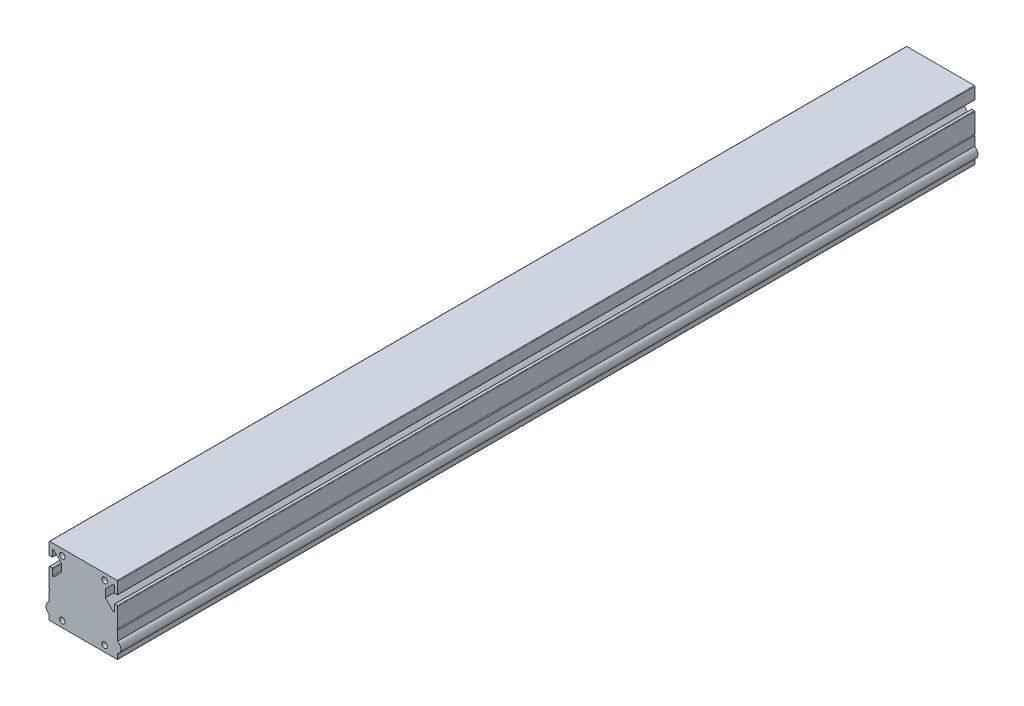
ISO-10303-21;
HEADER;
FILE_DESCRIPTION(('STEP AP214'),'2;1');
FILE_NAME('part.step','',(''),(''),'','','');
FILE_SCHEMA(('AUTOMOTIVE_DESIGN { 1 0 10303 214 1 1 1 1 }'));
ENDSEC;
DATA;
#1=APPLICATION_CONTEXT('core data for automotive mechanical design processes');
#2=APPLICATION_PROTOCOL_DEFINITION('international standard','automotive_design',2000,#1);
#3=PRODUCT_CONTEXT('',#1,'mechanical');
#4=PRODUCT('Part','Part','',(#3));
#5=PRODUCT_RELATED_PRODUCT_CATEGORY('part','',(#4));
#6=PRODUCT_DEFINITION_FORMATION('','',#4);
#7=PRODUCT_DEFINITION_CONTEXT('part definition',#1,'design');
#8=PRODUCT_DEFINITION('design','',#6,#7);
#9=PRODUCT_DEFINITION_SHAPE('','',#8);
#10=(LENGTH_UNIT() NAMED_UNIT(*) SI_UNIT(.MILLI.,.METRE.));
#11=(NAMED_UNIT(*) PLANE_ANGLE_UNIT() SI_UNIT($,.RADIAN.));
#12=(NAMED_UNIT(*) SI_UNIT($,.STERADIAN.) SOLID_ANGLE_UNIT());
#13=UNCERTAINTY_MEASURE_WITH_UNIT(LENGTH_MEASURE(1.E-05),#10,'distance_accuracy_value','');
#14=(GEOMETRIC_REPRESENTATION_CONTEXT(3) GLOBAL_UNCERTAINTY_ASSIGNED_CONTEXT((#13)) GLOBAL_UNIT_ASSIGNED_CONTEXT((#10,
#11,#12)) REPRESENTATION_CONTEXT('',''));
#15=CARTESIAN_POINT('',(0.,0.,0.));
#16=DIRECTION('',(0.,0.,1.));
#17=DIRECTION('',(1.,0.,0.));
#18=AXIS2_PLACEMENT_3D('',#15,#16,#17);
#19=CARTESIAN_POINT('',(-30.,30.,750.));
#20=DIRECTION('',(1.,0.,0.));
#21=DIRECTION('',(0.,1.,0.));
#22=AXIS2_PLACEMENT_3D('',#19,#20,#21);
#23=PLANE('',#22);
#24=DIRECTION('',(0.,-1.,0.));
#25=VECTOR('',#24,1.);
#26=CARTESIAN_POINT('',(-30.,30.,750.));
#27=LINE('',#26,#25);
#28=CARTESIAN_POINT('',(-30.,10.45,750.));
#29=VERTEX_POINT('',#28);
#30=CARTESIAN_POINT('',(-30.,-6.4,750.));
#31=VERTEX_POINT('',#30);
#32=EDGE_CURVE('E526',#29,#31,#27,.T.);
#33=ORIENTED_EDGE('',*,*,#32,.F.);
#34=DIRECTION('',(0.,0.,-1.));
#35=VECTOR('',#34,1.);
#36=CARTESIAN_POINT('',(-30.,10.45,750.));
#37=LINE('',#36,#35);
#38=CARTESIAN_POINT('',(-30.,10.45,0.));
#39=VERTEX_POINT('',#38);
#40=EDGE_CURVE('E610',#29,#39,#37,.T.);
#41=ORIENTED_EDGE('',*,*,#40,.T.);
#42=DIRECTION('',(0.,-1.,0.));
#43=VECTOR('',#42,1.);
#44=CARTESIAN_POINT('',(-30.,30.,0.));
#45=LINE('',#44,#43);
#46=CARTESIAN_POINT('',(-30.,-6.4,0.));
#47=VERTEX_POINT('',#46);
#48=EDGE_CURVE('E539',#39,#47,#45,.T.);
#49=ORIENTED_EDGE('',*,*,#48,.T.);
#50=DIRECTION('',(0.,0.,-1.));
#51=VECTOR('',#50,1.);
#52=CARTESIAN_POINT('',(-30.,-6.4,750.));
#53=LINE('',#52,#51);
#54=EDGE_CURVE('E448',#31,#47,#53,.T.);
#55=ORIENTED_EDGE('',*,*,#54,.F.);
#56=EDGE_LOOP('',(#33,#41,#49,#55));
#57=FACE_BOUND('',#56,.T.);
#58=ADVANCED_FACE('F32',(#57),#23,.F.);
#59=CARTESIAN_POINT('',(-30.,-25.6621064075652,750.));
#60=VERTEX_POINT('',#59);
#61=CARTESIAN_POINT('',(-30.,-29.5,750.));
#62=VERTEX_POINT('',#61);
#63=EDGE_CURVE('E520',#60,#62,#27,.T.);
#64=ORIENTED_EDGE('',*,*,#63,.F.);
#65=DIRECTION('',(0.,0.,-1.));
#66=VECTOR('',#65,1.);
#67=CARTESIAN_POINT('',(-30.,-25.6621064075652,750.));
#68=LINE('',#67,#66);
#69=CARTESIAN_POINT('',(-30.,-25.6621064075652,0.));
#70=VERTEX_POINT('',#69);
#71=EDGE_CURVE('E348',#60,#70,#68,.T.);
#72=ORIENTED_EDGE('',*,*,#71,.T.);
#73=CARTESIAN_POINT('',(-30.,-29.5,0.));
#74=VERTEX_POINT('',#73);
#75=EDGE_CURVE('E538',#70,#74,#45,.T.);
#76=ORIENTED_EDGE('',*,*,#75,.T.);
#77=DIRECTION('',(0.,0.,-1.));
#78=VECTOR('',#77,1.);
#79=CARTESIAN_POINT('',(-30.,-29.5,750.));
#80=LINE('',#79,#78);
#81=EDGE_CURVE('E571',#74,#62,#80,.F.);
#82=ORIENTED_EDGE('',*,*,#81,.T.);
#83=EDGE_LOOP('',(#64,#72,#76,#82));
#84=FACE_BOUND('',#83,.T.);
#85=ADVANCED_FACE('F809',(#84),#23,.F.);
#86=CARTESIAN_POINT('',(-30.,-7.6,0.));
#87=VERTEX_POINT('',#86);
#88=CARTESIAN_POINT('',(-30.,-15.7378935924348,0.));
#89=VERTEX_POINT('',#88);
#90=EDGE_CURVE('E541',#87,#89,#45,.T.);
#91=ORIENTED_EDGE('',*,*,#90,.T.);
#92=DIRECTION('',(0.,0.,-1.));
#93=VECTOR('',#92,1.);
#94=CARTESIAN_POINT('',(-30.,-15.7378935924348,750.));
#95=LINE('',#94,#93);
#96=CARTESIAN_POINT('',(-30.,-15.7378935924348,750.));
#97=VERTEX_POINT('',#96);
#98=EDGE_CURVE('E47',#89,#97,#95,.F.);
#99=ORIENTED_EDGE('',*,*,#98,.T.);
#100=CARTESIAN_POINT('',(-30.,-7.6,750.));
#101=VERTEX_POINT('',#100);
#102=EDGE_CURVE('E527',#101,#97,#27,.T.);
#103=ORIENTED_EDGE('',*,*,#102,.F.);
#104=DIRECTION('',(0.,0.,-1.));
#105=VECTOR('',#104,1.);
#106=CARTESIAN_POINT('',(-30.,-7.6,750.));
#107=LINE('',#106,#105);
#108=EDGE_CURVE('E444',#101,#87,#107,.T.);
#109=ORIENTED_EDGE('',*,*,#108,.T.);
#110=EDGE_LOOP('',(#91,#99,#103,#109));
#111=FACE_BOUND('',#110,.T.);
#112=ADVANCED_FACE('F816',(#111),#23,.F.);
#113=CARTESIAN_POINT('',(30.,-30.,750.));
#114=DIRECTION('',(0.,0.,-1.));
#115=DIRECTION('',(-1.,0.,0.));
#116=AXIS2_PLACEMENT_3D('',#113,#114,#115);
#117=PLANE('',#116);
#118=CARTESIAN_POINT('',(18.5,24.5,750.));
#119=DIRECTION('',(0.,0.,-1.));
#120=DIRECTION('',(-1.,0.,0.));
#121=AXIS2_PLACEMENT_3D('',#118,#119,#120);
#122=CIRCLE('',#121,2.44999999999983);
#123=CARTESIAN_POINT('',(16.0500000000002,24.5,750.));
#124=VERTEX_POINT('',#123);
#125=EDGE_CURVE('E371',#124,#124,#122,.T.);
#126=ORIENTED_EDGE('',*,*,#125,.T.);
#127=EDGE_LOOP('',(#126));
#128=FACE_BOUND('',#127,.T.);
#129=CARTESIAN_POINT('',(-18.5,24.5,750.));
#130=DIRECTION('',(0.,0.,-1.));
#131=DIRECTION('',(-1.,0.,0.));
#132=AXIS2_PLACEMENT_3D('',#129,#130,#131);
#133=CIRCLE('',#132,2.44999999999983);
#134=CARTESIAN_POINT('',(-20.9499999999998,24.5,750.));
#135=VERTEX_POINT('',#134);
#136=EDGE_CURVE('E377',#135,#135,#133,.T.);
#137=ORIENTED_EDGE('',*,*,#136,.T.);
#138=EDGE_LOOP('',(#137));
#139=FACE_BOUND('',#138,.T.);
#140=CARTESIAN_POINT('',(18.5,-24.5,750.));
#141=DIRECTION('',(0.,0.,-1.));
#142=DIRECTION('',(-1.,0.,0.));
#143=AXIS2_PLACEMENT_3D('',#140,#141,#142);
#144=CIRCLE('',#143,2.44999999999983);
#145=CARTESIAN_POINT('',(16.0500000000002,-24.5,750.));
#146=VERTEX_POINT('',#145);
#147=EDGE_CURVE('E383',#146,#146,#144,.T.);
#148=ORIENTED_EDGE('',*,*,#147,.T.);
#149=EDGE_LOOP('',(#148));
#150=FACE_BOUND('',#149,.T.);
#151=CARTESIAN_POINT('',(-18.5,-24.5,750.));
#152=DIRECTION('',(0.,0.,-1.));
#153=DIRECTION('',(-1.,0.,0.));
#154=AXIS2_PLACEMENT_3D('',#151,#152,#153);
#155=CIRCLE('',#154,2.44999999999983);
#156=CARTESIAN_POINT('',(-20.9499999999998,-24.5,750.));
#157=VERTEX_POINT('',#156);
#158=EDGE_CURVE('E389',#157,#157,#155,.T.);
#159=ORIENTED_EDGE('',*,*,#158,.T.);
#160=EDGE_LOOP('',(#159));
#161=FACE_BOUND('',#160,.T.);
#162=CARTESIAN_POINT('',(-29.7,-15.7378935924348,750.));
#163=DIRECTION('',(0.,0.,-1.));
#164=DIRECTION('',(-1.,0.,0.));
#165=AXIS2_PLACEMENT_3D('',#162,#163,#164);
#166=CIRCLE('',#165,0.3);
#167=CARTESIAN_POINT('',(-29.5878504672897,-16.0161425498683,750.));
#168=VERTEX_POINT('',#167);
#169=EDGE_CURVE('E703',#97,#168,#166,.F.);
#170=ORIENTED_EDGE('',*,*,#169,.T.);
#171=CARTESIAN_POINT('',(-27.7,-20.7,750.));
#172=DIRECTION('',(0.,0.,1.));
#173=DIRECTION('',(1.,0.,0.));
#174=AXIS2_PLACEMENT_3D('',#171,#172,#173);
#175=CIRCLE('',#174,5.05);
#176=CARTESIAN_POINT('',(-29.5878504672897,-25.3838574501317,750.));
#177=VERTEX_POINT('',#176);
#178=EDGE_CURVE('E362',#168,#177,#175,.T.);
#179=ORIENTED_EDGE('',*,*,#178,.T.);
#180=CARTESIAN_POINT('',(-29.7,-25.6621064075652,750.));
#181=DIRECTION('',(0.,0.,-1.));
#182=DIRECTION('',(-1.,0.,0.));
#183=AXIS2_PLACEMENT_3D('',#180,#181,#182);
#184=CIRCLE('',#183,0.3);
#185=EDGE_CURVE('E705',#177,#60,#184,.F.);
#186=ORIENTED_EDGE('',*,*,#185,.T.);
#187=ORIENTED_EDGE('',*,*,#63,.T.);
#188=CARTESIAN_POINT('',(-29.5,-29.5,750.));
#189=DIRECTION('',(0.,0.,-1.));
#190=DIRECTION('',(-1.,0.,0.));
#191=AXIS2_PLACEMENT_3D('',#188,#189,#190);
#192=CIRCLE('',#191,0.5);
#193=CARTESIAN_POINT('',(-29.5,-30.,750.));
#194=VERTEX_POINT('',#193);
#195=EDGE_CURVE('E596',#62,#194,#192,.F.);
#196=ORIENTED_EDGE('',*,*,#195,.T.);
#197=DIRECTION('',(1.,0.,0.));
#198=VECTOR('',#197,1.);
#199=CARTESIAN_POINT('',(30.,-30.,750.));
#200=LINE('',#199,#198);
#201=CARTESIAN_POINT('',(29.5,-30.,750.));
#202=VERTEX_POINT('',#201);
#203=EDGE_CURVE('E508',#194,#202,#200,.T.);
#204=ORIENTED_EDGE('',*,*,#203,.T.);
#205=CARTESIAN_POINT('',(29.5,-29.5,750.));
#206=DIRECTION('',(0.,0.,-1.));
#207=DIRECTION('',(-1.,0.,0.));
#208=AXIS2_PLACEMENT_3D('',#205,#206,#207);
#209=CIRCLE('',#208,0.5);
#210=CARTESIAN_POINT('',(30.,-29.5,750.));
#211=VERTEX_POINT('',#210);
#212=EDGE_CURVE('E584',#202,#211,#209,.F.);
#213=ORIENTED_EDGE('',*,*,#212,.T.);
#214=DIRECTION('',(0.,1.,0.));
#215=VECTOR('',#214,1.);
#216=CARTESIAN_POINT('',(30.,-30.,750.));
#217=LINE('',#216,#215);
#218=CARTESIAN_POINT('',(30.,-25.6621064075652,750.));
#219=VERTEX_POINT('',#218);
#220=EDGE_CURVE('E521',#211,#219,#217,.T.);
#221=ORIENTED_EDGE('',*,*,#220,.T.);
#222=CARTESIAN_POINT('',(29.7,-25.6621064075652,750.));
#223=DIRECTION('',(0.,0.,-1.));
#224=DIRECTION('',(-1.,0.,0.));
#225=AXIS2_PLACEMENT_3D('',#222,#223,#224);
#226=CIRCLE('',#225,0.3);
#227=CARTESIAN_POINT('',(29.5878504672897,-25.3838574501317,750.));
#228=VERTEX_POINT('',#227);
#229=EDGE_CURVE('E700',#219,#228,#226,.F.);
#230=ORIENTED_EDGE('',*,*,#229,.T.);
#231=CARTESIAN_POINT('',(27.7,-20.7,750.));
#232=DIRECTION('',(0.,0.,1.));
#233=DIRECTION('',(1.,0.,0.));
#234=AXIS2_PLACEMENT_3D('',#231,#232,#233);
#235=CIRCLE('',#234,5.05);
#236=CARTESIAN_POINT('',(29.5878504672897,-16.0161425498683,750.));
#237=VERTEX_POINT('',#236);
#238=EDGE_CURVE('E355',#228,#237,#235,.T.);
#239=ORIENTED_EDGE('',*,*,#238,.T.);
#240=CARTESIAN_POINT('',(29.7,-15.7378935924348,750.));
#241=DIRECTION('',(0.,0.,-1.));
#242=DIRECTION('',(-1.,0.,0.));
#243=AXIS2_PLACEMENT_3D('',#240,#241,#242);
#244=CIRCLE('',#243,0.3);
#245=CARTESIAN_POINT('',(30.,-15.7378935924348,750.));
#246=VERTEX_POINT('',#245);
#247=EDGE_CURVE('E55',#237,#246,#244,.F.);
#248=ORIENTED_EDGE('',*,*,#247,.T.);
#249=CARTESIAN_POINT('',(30.,-7.6,750.));
#250=VERTEX_POINT('',#249);
#251=EDGE_CURVE('E516',#246,#250,#217,.T.);
#252=ORIENTED_EDGE('',*,*,#251,.T.);
#253=CARTESIAN_POINT('',(30.,-7.,750.));
#254=DIRECTION('',(0.,0.,1.));
#255=DIRECTION('',(1.,0.,0.));
#256=AXIS2_PLACEMENT_3D('',#253,#254,#255);
#257=CIRCLE('',#256,0.6);
#258=CARTESIAN_POINT('',(30.,-6.4,750.));
#259=VERTEX_POINT('',#258);
#260=EDGE_CURVE('E496',#259,#250,#257,.T.);
#261=ORIENTED_EDGE('',*,*,#260,.F.);
#262=CARTESIAN_POINT('',(30.,10.45,750.));
#263=VERTEX_POINT('',#262);
#264=EDGE_CURVE('E515',#259,#263,#217,.T.);
#265=ORIENTED_EDGE('',*,*,#264,.T.);
#266=CARTESIAN_POINT('',(29.5,10.45,750.));
#267=DIRECTION('',(0.,0.,-1.));
#268=DIRECTION('',(-1.,0.,0.));
#269=AXIS2_PLACEMENT_3D('',#266,#267,#268);
#270=CIRCLE('',#269,0.5);
#271=CARTESIAN_POINT('',(29.5,10.95,750.));
#272=VERTEX_POINT('',#271);
#273=EDGE_CURVE('E578',#263,#272,#270,.F.);
#274=ORIENTED_EDGE('',*,*,#273,.T.);
#275=DIRECTION('',(1.,0.,0.));
#276=VECTOR('',#275,1.);
#277=CARTESIAN_POINT('',(30.,10.95,750.));
#278=LINE('',#277,#276);
#279=CARTESIAN_POINT('',(27.5,10.95,750.));
#280=VERTEX_POINT('',#279);
#281=EDGE_CURVE('E452',#280,#272,#278,.T.);
#282=ORIENTED_EDGE('',*,*,#281,.F.);
#283=CARTESIAN_POINT('',(27.5,10.45,750.));
#284=DIRECTION('',(0.,0.,-1.));
#285=DIRECTION('',(-1.,0.,0.));
#286=AXIS2_PLACEMENT_3D('',#283,#284,#285);
#287=CIRCLE('',#286,0.5);
#288=CARTESIAN_POINT('',(27.,10.45,750.));
#289=VERTEX_POINT('',#288);
#290=EDGE_CURVE('E576',#280,#289,#287,.F.);
#291=ORIENTED_EDGE('',*,*,#290,.T.);
#292=DIRECTION('',(0.,1.,0.));
#293=VECTOR('',#292,1.);
#294=CARTESIAN_POINT('',(27.,10.95,750.));
#295=LINE('',#294,#293);
#296=CARTESIAN_POINT('',(27.,5.00000000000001,750.));
#297=VERTEX_POINT('',#296);
#298=EDGE_CURVE('E469',#297,#289,#295,.T.);
#299=ORIENTED_EDGE('',*,*,#298,.F.);
#300=CARTESIAN_POINT('',(26.5,5.00000000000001,750.));
#301=DIRECTION('',(0.,0.,-1.));
#302=DIRECTION('',(-1.,0.,0.));
#303=AXIS2_PLACEMENT_3D('',#300,#301,#302);
#304=CIRCLE('',#303,0.5);
#305=CARTESIAN_POINT('',(26.1464466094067,4.64644660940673,750.));
#306=VERTEX_POINT('',#305);
#307=EDGE_CURVE('E681',#297,#306,#304,.T.);
#308=ORIENTED_EDGE('',*,*,#307,.T.);
#309=DIRECTION('',(0.707106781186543,-0.707106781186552,0.));
#310=VECTOR('',#309,1.);
#311=CARTESIAN_POINT('',(27.,3.79289321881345,750.));
#312=LINE('',#311,#310);
#313=CARTESIAN_POINT('',(19.2,11.5928932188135,750.));
#314=VERTEX_POINT('',#313);
#315=EDGE_CURVE('E466',#314,#306,#312,.T.);
#316=ORIENTED_EDGE('',*,*,#315,.F.);
#317=DIRECTION('',(0.,-1.,0.));
#318=VECTOR('',#317,1.);
#319=CARTESIAN_POINT('',(19.2,11.5928932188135,750.));
#320=LINE('',#319,#318);
#321=CARTESIAN_POINT('',(19.2,18.4071067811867,750.));
#322=VERTEX_POINT('',#321);
#323=EDGE_CURVE('E464',#322,#314,#320,.T.);
#324=ORIENTED_EDGE('',*,*,#323,.F.);
#325=DIRECTION('',(-0.707106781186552,-0.707106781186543,0.));
#326=VECTOR('',#325,1.);
#327=CARTESIAN_POINT('',(19.2,18.4071067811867,750.));
#328=LINE('',#327,#326);
#329=CARTESIAN_POINT('',(26.1464466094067,25.3535533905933,750.));
#330=VERTEX_POINT('',#329);
#331=EDGE_CURVE('E462',#330,#322,#328,.T.);
#332=ORIENTED_EDGE('',*,*,#331,.F.);
#333=CARTESIAN_POINT('',(26.5,25.,750.));
#334=DIRECTION('',(0.,0.,-1.));
#335=DIRECTION('',(-1.,0.,0.));
#336=AXIS2_PLACEMENT_3D('',#333,#334,#335);
#337=CIRCLE('',#336,0.5);
#338=CARTESIAN_POINT('',(27.,25.,750.));
#339=VERTEX_POINT('',#338);
#340=EDGE_CURVE('E685',#330,#339,#337,.T.);
#341=ORIENTED_EDGE('',*,*,#340,.T.);
#342=DIRECTION('',(0.,1.,0.));
#343=VECTOR('',#342,1.);
#344=CARTESIAN_POINT('',(27.,26.2071067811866,750.));
#345=LINE('',#344,#343);
#346=CARTESIAN_POINT('',(27.,19.55,750.));
#347=VERTEX_POINT('',#346);
#348=EDGE_CURVE('E459',#347,#339,#345,.T.);
#349=ORIENTED_EDGE('',*,*,#348,.F.);
#350=CARTESIAN_POINT('',(27.5,19.55,750.));
#351=DIRECTION('',(0.,0.,-1.));
#352=DIRECTION('',(-1.,0.,0.));
#353=AXIS2_PLACEMENT_3D('',#350,#351,#352);
#354=CIRCLE('',#353,0.5);
#355=CARTESIAN_POINT('',(27.5,19.05,750.));
#356=VERTEX_POINT('',#355);
#357=EDGE_CURVE('E574',#347,#356,#354,.F.);
#358=ORIENTED_EDGE('',*,*,#357,.T.);
#359=DIRECTION('',(-1.,0.,0.));
#360=VECTOR('',#359,1.);
#361=CARTESIAN_POINT('',(27.,19.05,750.));
#362=LINE('',#361,#360);
#363=CARTESIAN_POINT('',(29.5,19.05,750.));
#364=VERTEX_POINT('',#363);
#365=EDGE_CURVE('E455',#364,#356,#362,.T.);
#366=ORIENTED_EDGE('',*,*,#365,.F.);
#367=CARTESIAN_POINT('',(29.5,19.55,750.));
#368=DIRECTION('',(0.,0.,-1.));
#369=DIRECTION('',(-1.,0.,0.));
#370=AXIS2_PLACEMENT_3D('',#367,#368,#369);
#371=CIRCLE('',#370,0.5);
#372=CARTESIAN_POINT('',(30.,19.55,750.));
#373=VERTEX_POINT('',#372);
#374=EDGE_CURVE('E580',#364,#373,#371,.F.);
#375=ORIENTED_EDGE('',*,*,#374,.T.);
#376=CARTESIAN_POINT('',(30.,29.5,750.));
#377=VERTEX_POINT('',#376);
#378=EDGE_CURVE('E511',#373,#377,#217,.T.);
#379=ORIENTED_EDGE('',*,*,#378,.T.);
#380=CARTESIAN_POINT('',(29.5,29.5,750.));
#381=DIRECTION('',(0.,0.,-1.));
#382=DIRECTION('',(-1.,0.,0.));
#383=AXIS2_PLACEMENT_3D('',#380,#381,#382);
#384=CIRCLE('',#383,0.5);
#385=CARTESIAN_POINT('',(29.5,30.,750.));
#386=VERTEX_POINT('',#385);
#387=EDGE_CURVE('E582',#377,#386,#384,.F.);
#388=ORIENTED_EDGE('',*,*,#387,.T.);
#389=DIRECTION('',(-1.,0.,0.));
#390=VECTOR('',#389,1.);
#391=CARTESIAN_POINT('',(30.,30.,750.));
#392=LINE('',#391,#390);
#393=CARTESIAN_POINT('',(-29.5,30.,750.));
#394=VERTEX_POINT('',#393);
#395=EDGE_CURVE('E517',#386,#394,#392,.T.);
#396=ORIENTED_EDGE('',*,*,#395,.T.);
#397=CARTESIAN_POINT('',(-29.5,29.5,750.));
#398=DIRECTION('',(0.,0.,-1.));
#399=DIRECTION('',(-1.,0.,0.));
#400=AXIS2_PLACEMENT_3D('',#397,#398,#399);
#401=CIRCLE('',#400,0.5);
#402=CARTESIAN_POINT('',(-30.,29.5,750.));
#403=VERTEX_POINT('',#402);
#404=EDGE_CURVE('E590',#394,#403,#401,.F.);
#405=ORIENTED_EDGE('',*,*,#404,.T.);
#406=CARTESIAN_POINT('',(-30.,19.55,750.));
#407=VERTEX_POINT('',#406);
#408=EDGE_CURVE('E522',#403,#407,#27,.T.);
#409=ORIENTED_EDGE('',*,*,#408,.T.);
#410=CARTESIAN_POINT('',(-29.5,19.55,750.));
#411=DIRECTION('',(0.,0.,-1.));
#412=DIRECTION('',(-1.,0.,0.));
#413=AXIS2_PLACEMENT_3D('',#410,#411,#412);
#414=CIRCLE('',#413,0.5);
#415=CARTESIAN_POINT('',(-29.5,19.05,750.));
#416=VERTEX_POINT('',#415);
#417=EDGE_CURVE('E588',#407,#416,#414,.F.);
#418=ORIENTED_EDGE('',*,*,#417,.T.);
#419=DIRECTION('',(1.,0.,0.));
#420=VECTOR('',#419,1.);
#421=CARTESIAN_POINT('',(-27.,19.05,750.));
#422=LINE('',#421,#420);
#423=CARTESIAN_POINT('',(-27.5,19.05,750.));
#424=VERTEX_POINT('',#423);
#425=EDGE_CURVE('E414',#416,#424,#422,.T.);
#426=ORIENTED_EDGE('',*,*,#425,.T.);
#427=CARTESIAN_POINT('',(-27.5,19.55,750.));
#428=DIRECTION('',(0.,0.,-1.));
#429=DIRECTION('',(-1.,0.,0.));
#430=AXIS2_PLACEMENT_3D('',#427,#428,#429);
#431=CIRCLE('',#430,0.5);
#432=CARTESIAN_POINT('',(-27.,19.55,750.));
#433=VERTEX_POINT('',#432);
#434=EDGE_CURVE('E586',#424,#433,#431,.F.);
#435=ORIENTED_EDGE('',*,*,#434,.T.);
#436=DIRECTION('',(0.,1.,0.));
#437=VECTOR('',#436,1.);
#438=CARTESIAN_POINT('',(-27.,26.2071067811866,750.));
#439=LINE('',#438,#437);
#440=CARTESIAN_POINT('',(-27.,25.,750.));
#441=VERTEX_POINT('',#440);
#442=EDGE_CURVE('E411',#433,#441,#439,.T.);
#443=ORIENTED_EDGE('',*,*,#442,.T.);
#444=CARTESIAN_POINT('',(-26.5,25.,750.));
#445=DIRECTION('',(0.,0.,-1.));
#446=DIRECTION('',(-1.,0.,0.));
#447=AXIS2_PLACEMENT_3D('',#444,#445,#446);
#448=CIRCLE('',#447,0.5);
#449=CARTESIAN_POINT('',(-26.1464466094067,25.3535533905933,750.));
#450=VERTEX_POINT('',#449);
#451=EDGE_CURVE('E677',#441,#450,#448,.T.);
#452=ORIENTED_EDGE('',*,*,#451,.T.);
#453=DIRECTION('',(0.707106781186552,-0.707106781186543,0.));
#454=VECTOR('',#453,1.);
#455=CARTESIAN_POINT('',(-19.2,18.4071067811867,750.));
#456=LINE('',#455,#454);
#457=CARTESIAN_POINT('',(-19.2,18.4071067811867,750.));
#458=VERTEX_POINT('',#457);
#459=EDGE_CURVE('E409',#450,#458,#456,.T.);
#460=ORIENTED_EDGE('',*,*,#459,.T.);
#461=DIRECTION('',(0.,-1.,0.));
#462=VECTOR('',#461,1.);
#463=CARTESIAN_POINT('',(-19.2,11.5928932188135,750.));
#464=LINE('',#463,#462);
#465=CARTESIAN_POINT('',(-19.2,11.5928932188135,750.));
#466=VERTEX_POINT('',#465);
#467=EDGE_CURVE('E406',#458,#466,#464,.T.);
#468=ORIENTED_EDGE('',*,*,#467,.T.);
#469=DIRECTION('',(-0.707106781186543,-0.707106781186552,0.));
#470=VECTOR('',#469,1.);
#471=CARTESIAN_POINT('',(-27.,3.79289321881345,750.));
#472=LINE('',#471,#470);
#473=CARTESIAN_POINT('',(-26.1464466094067,4.64644660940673,750.));
#474=VERTEX_POINT('',#473);
#475=EDGE_CURVE('E403',#466,#474,#472,.T.);
#476=ORIENTED_EDGE('',*,*,#475,.T.);
#477=CARTESIAN_POINT('',(-26.5,5.00000000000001,750.));
#478=DIRECTION('',(0.,0.,-1.));
#479=DIRECTION('',(-1.,0.,0.));
#480=AXIS2_PLACEMENT_3D('',#477,#478,#479);
#481=CIRCLE('',#480,0.5);
#482=CARTESIAN_POINT('',(-27.,5.00000000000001,750.));
#483=VERTEX_POINT('',#482);
#484=EDGE_CURVE('E673',#474,#483,#481,.T.);
#485=ORIENTED_EDGE('',*,*,#484,.T.);
#486=DIRECTION('',(0.,1.,0.));
#487=VECTOR('',#486,1.);
#488=CARTESIAN_POINT('',(-27.,10.95,750.));
#489=LINE('',#488,#487);
#490=CARTESIAN_POINT('',(-27.,10.45,750.));
#491=VERTEX_POINT('',#490);
#492=EDGE_CURVE('E399',#483,#491,#489,.T.);
#493=ORIENTED_EDGE('',*,*,#492,.T.);
#494=CARTESIAN_POINT('',(-27.5,10.45,750.));
#495=DIRECTION('',(0.,0.,-1.));
#496=DIRECTION('',(-1.,0.,0.));
#497=AXIS2_PLACEMENT_3D('',#494,#495,#496);
#498=CIRCLE('',#497,0.5);
#499=CARTESIAN_POINT('',(-27.5,10.95,750.));
#500=VERTEX_POINT('',#499);
#501=EDGE_CURVE('E594',#491,#500,#498,.F.);
#502=ORIENTED_EDGE('',*,*,#501,.T.);
#503=DIRECTION('',(-1.,0.,0.));
#504=VECTOR('',#503,1.);
#505=CARTESIAN_POINT('',(-30.,10.95,750.));
#506=LINE('',#505,#504);
#507=CARTESIAN_POINT('',(-29.5,10.95,750.));
#508=VERTEX_POINT('',#507);
#509=EDGE_CURVE('E396',#500,#508,#506,.T.);
#510=ORIENTED_EDGE('',*,*,#509,.T.);
#511=CARTESIAN_POINT('',(-29.5,10.45,750.));
#512=DIRECTION('',(0.,0.,-1.));
#513=DIRECTION('',(-1.,0.,0.));
#514=AXIS2_PLACEMENT_3D('',#511,#512,#513);
#515=CIRCLE('',#514,0.5);
#516=EDGE_CURVE('E592',#508,#29,#515,.F.);
#517=ORIENTED_EDGE('',*,*,#516,.T.);
#518=ORIENTED_EDGE('',*,*,#32,.T.);
#519=CARTESIAN_POINT('',(-30.,-7.,750.));
#520=DIRECTION('',(0.,0.,-1.));
#521=DIRECTION('',(-1.,0.,0.));
#522=AXIS2_PLACEMENT_3D('',#519,#520,#521);
#523=CIRCLE('',#522,0.6);
#524=EDGE_CURVE('E441',#31,#101,#523,.T.);
#525=ORIENTED_EDGE('',*,*,#524,.T.);
#526=ORIENTED_EDGE('',*,*,#102,.T.);
#527=EDGE_LOOP('',(#170,#179,#186,#187,#196,#204,#213,#221,#230,#239,#248,#252,#261,#265,#274,
#282,#291,#299,#308,#316,#324,#332,#341,#349,#358,#366,#375,#379,#388,#396,#405,#409,#418,#426,
#435,#443,#452,#460,#468,#476,#485,#493,#502,#510,#517,#518,#525,#526));
#528=FACE_BOUND('',#527,.T.);
#529=ADVANCED_FACE('F710',(#128,#139,#150,#161,#528),#117,.F.);
#530=CARTESIAN_POINT('',(30.,-30.,0.));
#531=DIRECTION('',(0.,0.,-1.));
#532=DIRECTION('',(-1.,0.,0.));
#533=AXIS2_PLACEMENT_3D('',#530,#531,#532);
#534=PLANE('',#533);
#535=CARTESIAN_POINT('',(18.5,24.5,0.));
#536=DIRECTION('',(0.,0.,-1.));
#537=DIRECTION('',(-1.,0.,0.));
#538=AXIS2_PLACEMENT_3D('',#535,#536,#537);
#539=CIRCLE('',#538,2.44999999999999);
#540=CARTESIAN_POINT('',(16.05,24.5,0.));
#541=VERTEX_POINT('',#540);
#542=EDGE_CURVE('E374',#541,#541,#539,.T.);
#543=ORIENTED_EDGE('',*,*,#542,.F.);
#544=EDGE_LOOP('',(#543));
#545=FACE_BOUND('',#544,.T.);
#546=CARTESIAN_POINT('',(-18.5,24.5,0.));
#547=DIRECTION('',(0.,0.,-1.));
#548=DIRECTION('',(-1.,0.,0.));
#549=AXIS2_PLACEMENT_3D('',#546,#547,#548);
#550=CIRCLE('',#549,2.44999999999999);
#551=CARTESIAN_POINT('',(-20.95,24.5,0.));
#552=VERTEX_POINT('',#551);
#553=EDGE_CURVE('E380',#552,#552,#550,.T.);
#554=ORIENTED_EDGE('',*,*,#553,.F.);
#555=EDGE_LOOP('',(#554));
#556=FACE_BOUND('',#555,.T.);
#557=CARTESIAN_POINT('',(18.5,-24.5,0.));
#558=DIRECTION('',(0.,0.,-1.));
#559=DIRECTION('',(-1.,0.,0.));
#560=AXIS2_PLACEMENT_3D('',#557,#558,#559);
#561=CIRCLE('',#560,2.44999999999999);
#562=CARTESIAN_POINT('',(16.05,-24.5,0.));
#563=VERTEX_POINT('',#562);
#564=EDGE_CURVE('E386',#563,#563,#561,.T.);
#565=ORIENTED_EDGE('',*,*,#564,.F.);
#566=EDGE_LOOP('',(#565));
#567=FACE_BOUND('',#566,.T.);
#568=CARTESIAN_POINT('',(-18.5,-24.5,0.));
#569=DIRECTION('',(0.,0.,-1.));
#570=DIRECTION('',(-1.,0.,0.));
#571=AXIS2_PLACEMENT_3D('',#568,#569,#570);
#572=CIRCLE('',#571,2.44999999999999);
#573=CARTESIAN_POINT('',(-20.95,-24.5,0.));
#574=VERTEX_POINT('',#573);
#575=EDGE_CURVE('E392',#574,#574,#572,.T.);
#576=ORIENTED_EDGE('',*,*,#575,.F.);
#577=EDGE_LOOP('',(#576));
#578=FACE_BOUND('',#577,.T.);
#579=ORIENTED_EDGE('',*,*,#75,.F.);
#580=CARTESIAN_POINT('',(-29.7,-25.6621064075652,0.));
#581=DIRECTION('',(0.,0.,-1.));
#582=DIRECTION('',(-1.,0.,0.));
#583=AXIS2_PLACEMENT_3D('',#580,#581,#582);
#584=CIRCLE('',#583,0.3);
#585=CARTESIAN_POINT('',(-29.5878504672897,-25.3838574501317,0.));
#586=VERTEX_POINT('',#585);
#587=EDGE_CURVE('E692',#70,#586,#584,.T.);
#588=ORIENTED_EDGE('',*,*,#587,.T.);
#589=CARTESIAN_POINT('',(-27.7,-20.7,0.));
#590=DIRECTION('',(0.,0.,-1.));
#591=DIRECTION('',(-1.,0.,0.));
#592=AXIS2_PLACEMENT_3D('',#589,#590,#591);
#593=CIRCLE('',#592,5.05);
#594=CARTESIAN_POINT('',(-29.5878504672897,-16.0161425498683,0.));
#595=VERTEX_POINT('',#594);
#596=EDGE_CURVE('E365',#595,#586,#593,.F.);
#597=ORIENTED_EDGE('',*,*,#596,.F.);
#598=CARTESIAN_POINT('',(-29.7,-15.7378935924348,0.));
#599=DIRECTION('',(0.,0.,-1.));
#600=DIRECTION('',(-1.,0.,0.));
#601=AXIS2_PLACEMENT_3D('',#598,#599,#600);
#602=CIRCLE('',#601,0.3);
#603=EDGE_CURVE('E690',#595,#89,#602,.T.);
#604=ORIENTED_EDGE('',*,*,#603,.T.);
#605=ORIENTED_EDGE('',*,*,#90,.F.);
#606=CARTESIAN_POINT('',(-30.,-7.,0.));
#607=DIRECTION('',(0.,0.,-1.));
#608=DIRECTION('',(-1.,0.,0.));
#609=AXIS2_PLACEMENT_3D('',#606,#607,#608);
#610=CIRCLE('',#609,0.6);
#611=EDGE_CURVE('E440',#47,#87,#610,.T.);
#612=ORIENTED_EDGE('',*,*,#611,.F.);
#613=ORIENTED_EDGE('',*,*,#48,.F.);
#614=CARTESIAN_POINT('',(-29.5,10.45,0.));
#615=DIRECTION('',(0.,0.,-1.));
#616=DIRECTION('',(-1.,0.,0.));
#617=AXIS2_PLACEMENT_3D('',#614,#615,#616);
#618=CIRCLE('',#617,0.5);
#619=CARTESIAN_POINT('',(-29.5,10.95,0.));
#620=VERTEX_POINT('',#619);
#621=EDGE_CURVE('E564',#39,#620,#618,.T.);
#622=ORIENTED_EDGE('',*,*,#621,.T.);
#623=DIRECTION('',(-1.,0.,0.));
#624=VECTOR('',#623,1.);
#625=CARTESIAN_POINT('',(-30.,10.95,0.));
#626=LINE('',#625,#624);
#627=CARTESIAN_POINT('',(-27.5,10.95,0.));
#628=VERTEX_POINT('',#627);
#629=EDGE_CURVE('E395',#628,#620,#626,.T.);
#630=ORIENTED_EDGE('',*,*,#629,.F.);
#631=CARTESIAN_POINT('',(-27.5,10.45,0.));
#632=DIRECTION('',(0.,0.,-1.));
#633=DIRECTION('',(-1.,0.,0.));
#634=AXIS2_PLACEMENT_3D('',#631,#632,#633);
#635=CIRCLE('',#634,0.5);
#636=CARTESIAN_POINT('',(-27.,10.45,0.));
#637=VERTEX_POINT('',#636);
#638=EDGE_CURVE('E566',#628,#637,#635,.T.);
#639=ORIENTED_EDGE('',*,*,#638,.T.);
#640=DIRECTION('',(0.,1.,0.));
#641=VECTOR('',#640,1.);
#642=CARTESIAN_POINT('',(-27.,10.95,0.));
#643=LINE('',#642,#641);
#644=CARTESIAN_POINT('',(-27.,5.00000000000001,0.));
#645=VERTEX_POINT('',#644);
#646=EDGE_CURVE('E420',#645,#637,#643,.T.);
#647=ORIENTED_EDGE('',*,*,#646,.F.);
#648=CARTESIAN_POINT('',(-26.5,5.00000000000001,0.));
#649=DIRECTION('',(0.,0.,-1.));
#650=DIRECTION('',(-1.,0.,0.));
#651=AXIS2_PLACEMENT_3D('',#648,#649,#650);
#652=CIRCLE('',#651,0.5);
#653=CARTESIAN_POINT('',(-26.1464466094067,4.64644660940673,0.));
#654=VERTEX_POINT('',#653);
#655=EDGE_CURVE('E671',#645,#654,#652,.F.);
#656=ORIENTED_EDGE('',*,*,#655,.T.);
#657=DIRECTION('',(-0.707106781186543,-0.707106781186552,0.));
#658=VECTOR('',#657,1.);
#659=CARTESIAN_POINT('',(-27.,3.79289321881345,0.));
#660=LINE('',#659,#658);
#661=CARTESIAN_POINT('',(-19.2,11.5928932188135,0.));
#662=VERTEX_POINT('',#661);
#663=EDGE_CURVE('E423',#662,#654,#660,.T.);
#664=ORIENTED_EDGE('',*,*,#663,.F.);
#665=DIRECTION('',(0.,-1.,0.));
#666=VECTOR('',#665,1.);
#667=CARTESIAN_POINT('',(-19.2,11.5928932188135,0.));
#668=LINE('',#667,#666);
#669=CARTESIAN_POINT('',(-19.2,18.4071067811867,0.));
#670=VERTEX_POINT('',#669);
#671=EDGE_CURVE('E426',#670,#662,#668,.T.);
#672=ORIENTED_EDGE('',*,*,#671,.F.);
#673=DIRECTION('',(0.707106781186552,-0.707106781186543,0.));
#674=VECTOR('',#673,1.);
#675=CARTESIAN_POINT('',(-19.2,18.4071067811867,0.));
#676=LINE('',#675,#674);
#677=CARTESIAN_POINT('',(-26.1464466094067,25.3535533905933,0.));
#678=VERTEX_POINT('',#677);
#679=EDGE_CURVE('E429',#678,#670,#676,.T.);
#680=ORIENTED_EDGE('',*,*,#679,.F.);
#681=CARTESIAN_POINT('',(-26.5,25.,0.));
#682=DIRECTION('',(0.,0.,-1.));
#683=DIRECTION('',(-1.,0.,0.));
#684=AXIS2_PLACEMENT_3D('',#681,#682,#683);
#685=CIRCLE('',#684,0.5);
#686=CARTESIAN_POINT('',(-27.,25.,0.));
#687=VERTEX_POINT('',#686);
#688=EDGE_CURVE('E675',#678,#687,#685,.F.);
#689=ORIENTED_EDGE('',*,*,#688,.T.);
#690=DIRECTION('',(0.,1.,0.));
#691=VECTOR('',#690,1.);
#692=CARTESIAN_POINT('',(-27.,26.2071067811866,0.));
#693=LINE('',#692,#691);
#694=CARTESIAN_POINT('',(-27.,19.55,0.));
#695=VERTEX_POINT('',#694);
#696=EDGE_CURVE('E431',#695,#687,#693,.T.);
#697=ORIENTED_EDGE('',*,*,#696,.F.);
#698=CARTESIAN_POINT('',(-27.5,19.55,0.));
#699=DIRECTION('',(0.,0.,-1.));
#700=DIRECTION('',(-1.,0.,0.));
#701=AXIS2_PLACEMENT_3D('',#698,#699,#700);
#702=CIRCLE('',#701,0.5);
#703=CARTESIAN_POINT('',(-27.5,19.05,0.));
#704=VERTEX_POINT('',#703);
#705=EDGE_CURVE('E558',#695,#704,#702,.T.);
#706=ORIENTED_EDGE('',*,*,#705,.T.);
#707=DIRECTION('',(1.,0.,0.));
#708=VECTOR('',#707,1.);
#709=CARTESIAN_POINT('',(-27.,19.05,0.));
#710=LINE('',#709,#708);
#711=CARTESIAN_POINT('',(-29.5,19.05,0.));
#712=VERTEX_POINT('',#711);
#713=EDGE_CURVE('E400',#712,#704,#710,.T.);
#714=ORIENTED_EDGE('',*,*,#713,.F.);
#715=CARTESIAN_POINT('',(-29.5,19.55,0.));
#716=DIRECTION('',(0.,0.,-1.));
#717=DIRECTION('',(-1.,0.,0.));
#718=AXIS2_PLACEMENT_3D('',#715,#716,#717);
#719=CIRCLE('',#718,0.5);
#720=CARTESIAN_POINT('',(-30.,19.55,0.));
#721=VERTEX_POINT('',#720);
#722=EDGE_CURVE('E560',#712,#721,#719,.T.);
#723=ORIENTED_EDGE('',*,*,#722,.T.);
#724=CARTESIAN_POINT('',(-30.,29.5,0.));
#725=VERTEX_POINT('',#724);
#726=EDGE_CURVE('E512',#725,#721,#45,.T.);
#727=ORIENTED_EDGE('',*,*,#726,.F.);
#728=CARTESIAN_POINT('',(-29.5,29.5,0.));
#729=DIRECTION('',(0.,0.,-1.));
#730=DIRECTION('',(-1.,0.,0.));
#731=AXIS2_PLACEMENT_3D('',#728,#729,#730);
#732=CIRCLE('',#731,0.5);
#733=CARTESIAN_POINT('',(-29.5,30.,0.));
#734=VERTEX_POINT('',#733);
#735=EDGE_CURVE('E562',#725,#734,#732,.T.);
#736=ORIENTED_EDGE('',*,*,#735,.T.);
#737=DIRECTION('',(-1.,0.,0.));
#738=VECTOR('',#737,1.);
#739=CARTESIAN_POINT('',(30.,30.,0.));
#740=LINE('',#739,#738);
#741=CARTESIAN_POINT('',(29.5,30.,0.));
#742=VERTEX_POINT('',#741);
#743=EDGE_CURVE('E533',#742,#734,#740,.T.);
#744=ORIENTED_EDGE('',*,*,#743,.F.);
#745=CARTESIAN_POINT('',(29.5,29.5,0.));
#746=DIRECTION('',(0.,0.,-1.));
#747=DIRECTION('',(-1.,0.,0.));
#748=AXIS2_PLACEMENT_3D('',#745,#746,#747);
#749=CIRCLE('',#748,0.5);
#750=CARTESIAN_POINT('',(30.,29.5,0.));
#751=VERTEX_POINT('',#750);
#752=EDGE_CURVE('E554',#742,#751,#749,.T.);
#753=ORIENTED_EDGE('',*,*,#752,.T.);
#754=DIRECTION('',(0.,1.,0.));
#755=VECTOR('',#754,1.);
#756=CARTESIAN_POINT('',(30.,-30.,0.));
#757=LINE('',#756,#755);
#758=CARTESIAN_POINT('',(30.,19.55,0.));
#759=VERTEX_POINT('',#758);
#760=EDGE_CURVE('E530',#759,#751,#757,.T.);
#761=ORIENTED_EDGE('',*,*,#760,.F.);
#762=CARTESIAN_POINT('',(29.5,19.55,0.));
#763=DIRECTION('',(0.,0.,-1.));
#764=DIRECTION('',(-1.,0.,0.));
#765=AXIS2_PLACEMENT_3D('',#762,#763,#764);
#766=CIRCLE('',#765,0.5);
#767=CARTESIAN_POINT('',(29.5,19.05,0.));
#768=VERTEX_POINT('',#767);
#769=EDGE_CURVE('E552',#759,#768,#766,.T.);
#770=ORIENTED_EDGE('',*,*,#769,.T.);
#771=DIRECTION('',(-1.,0.,0.));
#772=VECTOR('',#771,1.);
#773=CARTESIAN_POINT('',(27.,19.05,0.));
#774=LINE('',#773,#772);
#775=CARTESIAN_POINT('',(27.5,19.05,0.));
#776=VERTEX_POINT('',#775);
#777=EDGE_CURVE('E475',#768,#776,#774,.T.);
#778=ORIENTED_EDGE('',*,*,#777,.T.);
#779=CARTESIAN_POINT('',(27.5,19.55,0.));
#780=DIRECTION('',(0.,0.,-1.));
#781=DIRECTION('',(-1.,0.,0.));
#782=AXIS2_PLACEMENT_3D('',#779,#780,#781);
#783=CIRCLE('',#782,0.5);
#784=CARTESIAN_POINT('',(27.,19.55,0.));
#785=VERTEX_POINT('',#784);
#786=EDGE_CURVE('E546',#776,#785,#783,.T.);
#787=ORIENTED_EDGE('',*,*,#786,.T.);
#788=DIRECTION('',(0.,1.,0.));
#789=VECTOR('',#788,1.);
#790=CARTESIAN_POINT('',(27.,26.2071067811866,0.));
#791=LINE('',#790,#789);
#792=CARTESIAN_POINT('',(27.,25.,0.));
#793=VERTEX_POINT('',#792);
#794=EDGE_CURVE('E478',#785,#793,#791,.T.);
#795=ORIENTED_EDGE('',*,*,#794,.T.);
#796=CARTESIAN_POINT('',(26.5,25.,0.));
#797=DIRECTION('',(0.,0.,-1.));
#798=DIRECTION('',(-1.,0.,0.));
#799=AXIS2_PLACEMENT_3D('',#796,#797,#798);
#800=CIRCLE('',#799,0.5);
#801=CARTESIAN_POINT('',(26.1464466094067,25.3535533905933,0.));
#802=VERTEX_POINT('',#801);
#803=EDGE_CURVE('E683',#793,#802,#800,.F.);
#804=ORIENTED_EDGE('',*,*,#803,.T.);
#805=DIRECTION('',(-0.707106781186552,-0.707106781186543,0.));
#806=VECTOR('',#805,1.);
#807=CARTESIAN_POINT('',(19.2,18.4071067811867,0.));
#808=LINE('',#807,#806);
#809=CARTESIAN_POINT('',(19.2,18.4071067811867,0.));
#810=VERTEX_POINT('',#809);
#811=EDGE_CURVE('E481',#802,#810,#808,.T.);
#812=ORIENTED_EDGE('',*,*,#811,.T.);
#813=DIRECTION('',(0.,-1.,0.));
#814=VECTOR('',#813,1.);
#815=CARTESIAN_POINT('',(19.2,11.5928932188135,0.));
#816=LINE('',#815,#814);
#817=CARTESIAN_POINT('',(19.2,11.5928932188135,0.));
#818=VERTEX_POINT('',#817);
#819=EDGE_CURVE('E483',#810,#818,#816,.T.);
#820=ORIENTED_EDGE('',*,*,#819,.T.);
#821=DIRECTION('',(0.707106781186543,-0.707106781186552,0.));
#822=VECTOR('',#821,1.);
#823=CARTESIAN_POINT('',(27.,3.79289321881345,0.));
#824=LINE('',#823,#822);
#825=CARTESIAN_POINT('',(26.1464466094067,4.64644660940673,0.));
#826=VERTEX_POINT('',#825);
#827=EDGE_CURVE('E486',#818,#826,#824,.T.);
#828=ORIENTED_EDGE('',*,*,#827,.T.);
#829=CARTESIAN_POINT('',(26.5,5.00000000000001,0.));
#830=DIRECTION('',(0.,0.,-1.));
#831=DIRECTION('',(-1.,0.,0.));
#832=AXIS2_PLACEMENT_3D('',#829,#830,#831);
#833=CIRCLE('',#832,0.5);
#834=CARTESIAN_POINT('',(27.,5.00000000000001,0.));
#835=VERTEX_POINT('',#834);
#836=EDGE_CURVE('E679',#826,#835,#833,.F.);
#837=ORIENTED_EDGE('',*,*,#836,.T.);
#838=DIRECTION('',(0.,1.,0.));
#839=VECTOR('',#838,1.);
#840=CARTESIAN_POINT('',(27.,10.95,0.));
#841=LINE('',#840,#839);
#842=CARTESIAN_POINT('',(27.,10.45,0.));
#843=VERTEX_POINT('',#842);
#844=EDGE_CURVE('E456',#835,#843,#841,.T.);
#845=ORIENTED_EDGE('',*,*,#844,.T.);
#846=CARTESIAN_POINT('',(27.5,10.45,0.));
#847=DIRECTION('',(0.,0.,-1.));
#848=DIRECTION('',(-1.,0.,0.));
#849=AXIS2_PLACEMENT_3D('',#846,#847,#848);
#850=CIRCLE('',#849,0.5);
#851=CARTESIAN_POINT('',(27.5,10.95,0.));
#852=VERTEX_POINT('',#851);
#853=EDGE_CURVE('E548',#843,#852,#850,.T.);
#854=ORIENTED_EDGE('',*,*,#853,.T.);
#855=DIRECTION('',(1.,0.,0.));
#856=VECTOR('',#855,1.);
#857=CARTESIAN_POINT('',(30.,10.95,0.));
#858=LINE('',#857,#856);
#859=CARTESIAN_POINT('',(29.5,10.95,0.));
#860=VERTEX_POINT('',#859);
#861=EDGE_CURVE('E451',#852,#860,#858,.T.);
#862=ORIENTED_EDGE('',*,*,#861,.T.);
#863=CARTESIAN_POINT('',(29.5,10.45,0.));
#864=DIRECTION('',(0.,0.,-1.));
#865=DIRECTION('',(-1.,0.,0.));
#866=AXIS2_PLACEMENT_3D('',#863,#864,#865);
#867=CIRCLE('',#866,0.5);
#868=CARTESIAN_POINT('',(30.,10.45,0.));
#869=VERTEX_POINT('',#868);
#870=EDGE_CURVE('E550',#860,#869,#867,.T.);
#871=ORIENTED_EDGE('',*,*,#870,.T.);
#872=CARTESIAN_POINT('',(30.,-6.4,0.));
#873=VERTEX_POINT('',#872);
#874=EDGE_CURVE('E535',#873,#869,#757,.T.);
#875=ORIENTED_EDGE('',*,*,#874,.F.);
#876=CARTESIAN_POINT('',(30.,-7.,0.));
#877=DIRECTION('',(0.,0.,1.));
#878=DIRECTION('',(1.,0.,0.));
#879=AXIS2_PLACEMENT_3D('',#876,#877,#878);
#880=CIRCLE('',#879,0.6);
#881=CARTESIAN_POINT('',(30.,-7.6,0.));
#882=VERTEX_POINT('',#881);
#883=EDGE_CURVE('E495',#873,#882,#880,.T.);
#884=ORIENTED_EDGE('',*,*,#883,.T.);
#885=CARTESIAN_POINT('',(30.,-15.7378935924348,0.));
#886=VERTEX_POINT('',#885);
#887=EDGE_CURVE('E534',#886,#882,#757,.T.);
#888=ORIENTED_EDGE('',*,*,#887,.F.);
#889=CARTESIAN_POINT('',(29.7,-15.7378935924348,0.));
#890=DIRECTION('',(0.,0.,-1.));
#891=DIRECTION('',(-1.,0.,0.));
#892=AXIS2_PLACEMENT_3D('',#889,#890,#891);
#893=CIRCLE('',#892,0.3);
#894=CARTESIAN_POINT('',(29.5878504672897,-16.0161425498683,0.));
#895=VERTEX_POINT('',#894);
#896=EDGE_CURVE('E347',#886,#895,#893,.T.);
#897=ORIENTED_EDGE('',*,*,#896,.T.);
#898=CARTESIAN_POINT('',(27.7,-20.7,0.));
#899=DIRECTION('',(0.,0.,-1.));
#900=DIRECTION('',(-1.,0.,0.));
#901=AXIS2_PLACEMENT_3D('',#898,#899,#900);
#902=CIRCLE('',#901,5.05);
#903=CARTESIAN_POINT('',(29.5878504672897,-25.3838574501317,0.));
#904=VERTEX_POINT('',#903);
#905=EDGE_CURVE('E354',#904,#895,#902,.F.);
#906=ORIENTED_EDGE('',*,*,#905,.F.);
#907=CARTESIAN_POINT('',(29.7,-25.6621064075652,0.));
#908=DIRECTION('',(0.,0.,-1.));
#909=DIRECTION('',(-1.,0.,0.));
#910=AXIS2_PLACEMENT_3D('',#907,#908,#909);
#911=CIRCLE('',#910,0.3);
#912=CARTESIAN_POINT('',(30.,-25.6621064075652,0.));
#913=VERTEX_POINT('',#912);
#914=EDGE_CURVE('E338',#904,#913,#911,.T.);
#915=ORIENTED_EDGE('',*,*,#914,.T.);
#916=CARTESIAN_POINT('',(30.,-29.5,0.));
#917=VERTEX_POINT('',#916);
#918=EDGE_CURVE('E531',#917,#913,#757,.T.);
#919=ORIENTED_EDGE('',*,*,#918,.F.);
#920=CARTESIAN_POINT('',(29.5,-29.5,0.));
#921=DIRECTION('',(0.,0.,-1.));
#922=DIRECTION('',(-1.,0.,0.));
#923=AXIS2_PLACEMENT_3D('',#920,#921,#922);
#924=CIRCLE('',#923,0.5);
#925=CARTESIAN_POINT('',(29.5,-30.,0.));
#926=VERTEX_POINT('',#925);
#927=EDGE_CURVE('E556',#917,#926,#924,.T.);
#928=ORIENTED_EDGE('',*,*,#927,.T.);
#929=DIRECTION('',(1.,0.,0.));
#930=VECTOR('',#929,1.);
#931=CARTESIAN_POINT('',(30.,-30.,0.));
#932=LINE('',#931,#930);
#933=CARTESIAN_POINT('',(-29.5,-30.,0.));
#934=VERTEX_POINT('',#933);
#935=EDGE_CURVE('E507',#934,#926,#932,.T.);
#936=ORIENTED_EDGE('',*,*,#935,.F.);
#937=CARTESIAN_POINT('',(-29.5,-29.5,0.));
#938=DIRECTION('',(0.,0.,-1.));
#939=DIRECTION('',(-1.,0.,0.));
#940=AXIS2_PLACEMENT_3D('',#937,#938,#939);
#941=CIRCLE('',#940,0.5);
#942=EDGE_CURVE('E568',#934,#74,#941,.T.);
#943=ORIENTED_EDGE('',*,*,#942,.T.);
#944=EDGE_LOOP('',(#579,#588,#597,#604,#605,#612,#613,#622,#630,#639,#647,#656,#664,#672,#680,
#689,#697,#706,#714,#723,#727,#736,#744,#753,#761,#770,#778,#787,#795,#804,#812,#820,#828,#837,
#845,#854,#862,#871,#875,#884,#888,#897,#906,#915,#919,#928,#936,#943));
#945=FACE_BOUND('',#944,.T.);
#946=ADVANCED_FACE('F359',(#545,#556,#567,#578,#945),#534,.T.);
#947=CARTESIAN_POINT('',(30.,-30.,750.));
#948=DIRECTION('',(-1.,0.,0.));
#949=DIRECTION('',(0.,0.,1.));
#950=AXIS2_PLACEMENT_3D('',#947,#948,#949);
#951=PLANE('',#950);
#952=ORIENTED_EDGE('',*,*,#874,.T.);
#953=DIRECTION('',(0.,0.,-1.));
#954=VECTOR('',#953,1.);
#955=CARTESIAN_POINT('',(30.,10.45,750.));
#956=LINE('',#955,#954);
#957=EDGE_CURVE('E654',#869,#263,#956,.F.);
#958=ORIENTED_EDGE('',*,*,#957,.T.);
#959=ORIENTED_EDGE('',*,*,#264,.F.);
#960=DIRECTION('',(0.,0.,-1.));
#961=VECTOR('',#960,1.);
#962=CARTESIAN_POINT('',(30.,-6.4,750.));
#963=LINE('',#962,#961);
#964=EDGE_CURVE('E499',#259,#873,#963,.T.);
#965=ORIENTED_EDGE('',*,*,#964,.T.);
#966=EDGE_LOOP('',(#952,#958,#959,#965));
#967=FACE_BOUND('',#966,.T.);
#968=ADVANCED_FACE('F794',(#967),#951,.F.);
#969=ORIENTED_EDGE('',*,*,#760,.T.);
#970=DIRECTION('',(0.,0.,-1.));
#971=VECTOR('',#970,1.);
#972=CARTESIAN_POINT('',(30.,29.5,750.));
#973=LINE('',#972,#971);
#974=EDGE_CURVE('E642',#751,#377,#973,.F.);
#975=ORIENTED_EDGE('',*,*,#974,.T.);
#976=ORIENTED_EDGE('',*,*,#378,.F.);
#977=DIRECTION('',(0.,0.,-1.));
#978=VECTOR('',#977,1.);
#979=CARTESIAN_POINT('',(30.,19.55,0.));
#980=LINE('',#979,#978);
#981=EDGE_CURVE('E639',#373,#759,#980,.T.);
#982=ORIENTED_EDGE('',*,*,#981,.T.);
#983=EDGE_LOOP('',(#969,#975,#976,#982));
#984=FACE_BOUND('',#983,.T.);
#985=ADVANCED_FACE('F785',(#984),#951,.F.);
#986=ORIENTED_EDGE('',*,*,#251,.F.);
#987=DIRECTION('',(0.,0.,1.));
#988=VECTOR('',#987,1.);
#989=CARTESIAN_POINT('',(30.,-15.7378935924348,0.));
#990=LINE('',#989,#988);
#991=EDGE_CURVE('E356',#246,#886,#990,.F.);
#992=ORIENTED_EDGE('',*,*,#991,.T.);
#993=ORIENTED_EDGE('',*,*,#887,.T.);
#994=DIRECTION('',(0.,0.,-1.));
#995=VECTOR('',#994,1.);
#996=CARTESIAN_POINT('',(30.,-7.6,750.));
#997=LINE('',#996,#995);
#998=EDGE_CURVE('E504',#250,#882,#997,.T.);
#999=ORIENTED_EDGE('',*,*,#998,.F.);
#1000=EDGE_LOOP('',(#986,#992,#993,#999));
#1001=FACE_BOUND('',#1000,.T.);
#1002=ADVANCED_FACE('F790',(#1001),#951,.F.);
#1003=ORIENTED_EDGE('',*,*,#918,.T.);
#1004=DIRECTION('',(0.,0.,1.));
#1005=VECTOR('',#1004,1.);
#1006=CARTESIAN_POINT('',(30.,-25.6621064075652,750.));
#1007=LINE('',#1006,#1005);
#1008=EDGE_CURVE('E11',#913,#219,#1007,.T.);
#1009=ORIENTED_EDGE('',*,*,#1008,.T.);
#1010=ORIENTED_EDGE('',*,*,#220,.F.);
#1011=DIRECTION('',(0.,0.,-1.));
#1012=VECTOR('',#1011,1.);
#1013=CARTESIAN_POINT('',(30.,-29.5,750.));
#1014=LINE('',#1013,#1012);
#1015=EDGE_CURVE('E636',#211,#917,#1014,.T.);
#1016=ORIENTED_EDGE('',*,*,#1015,.T.);
#1017=EDGE_LOOP('',(#1003,#1009,#1010,#1016));
#1018=FACE_BOUND('',#1017,.T.);
#1019=ADVANCED_FACE('F797',(#1018),#951,.F.);
#1020=CARTESIAN_POINT('',(30.,-30.,750.));
#1021=DIRECTION('',(0.,1.,0.));
#1022=DIRECTION('',(0.,0.,1.));
#1023=AXIS2_PLACEMENT_3D('',#1020,#1021,#1022);
#1024=PLANE('',#1023);
#1025=ORIENTED_EDGE('',*,*,#203,.F.);
#1026=DIRECTION('',(0.,0.,-1.));
#1027=VECTOR('',#1026,1.);
#1028=CARTESIAN_POINT('',(-29.5,-30.,750.));
#1029=LINE('',#1028,#1027);
#1030=EDGE_CURVE('E543',#194,#934,#1029,.T.);
#1031=ORIENTED_EDGE('',*,*,#1030,.T.);
#1032=ORIENTED_EDGE('',*,*,#935,.T.);
#1033=DIRECTION('',(0.,0.,-1.));
#1034=VECTOR('',#1033,1.);
#1035=CARTESIAN_POINT('',(29.5,-30.,750.));
#1036=LINE('',#1035,#1034);
#1037=EDGE_CURVE('E525',#926,#202,#1036,.F.);
#1038=ORIENTED_EDGE('',*,*,#1037,.T.);
#1039=EDGE_LOOP('',(#1025,#1031,#1032,#1038));
#1040=FACE_BOUND('',#1039,.T.);
#1041=ADVANCED_FACE('F807',(#1040),#1024,.F.);
#1042=CARTESIAN_POINT('',(30.,30.,750.));
#1043=DIRECTION('',(0.,-1.,0.));
#1044=DIRECTION('',(0.,0.,-1.));
#1045=AXIS2_PLACEMENT_3D('',#1042,#1043,#1044);
#1046=PLANE('',#1045);
#1047=ORIENTED_EDGE('',*,*,#743,.T.);
#1048=DIRECTION('',(0.,0.,-1.));
#1049=VECTOR('',#1048,1.);
#1050=CARTESIAN_POINT('',(-29.5,30.,750.));
#1051=LINE('',#1050,#1049);
#1052=EDGE_CURVE('E621',#734,#394,#1051,.F.);
#1053=ORIENTED_EDGE('',*,*,#1052,.T.);
#1054=ORIENTED_EDGE('',*,*,#395,.F.);
#1055=DIRECTION('',(0.,0.,-1.));
#1056=VECTOR('',#1055,1.);
#1057=CARTESIAN_POINT('',(29.5,30.,750.));
#1058=LINE('',#1057,#1056);
#1059=EDGE_CURVE('E618',#386,#742,#1058,.T.);
#1060=ORIENTED_EDGE('',*,*,#1059,.T.);
#1061=EDGE_LOOP('',(#1047,#1053,#1054,#1060));
#1062=FACE_BOUND('',#1061,.T.);
#1063=ADVANCED_FACE('F820',(#1062),#1046,.F.);
#1064=ORIENTED_EDGE('',*,*,#408,.F.);
#1065=DIRECTION('',(0.,0.,-1.));
#1066=VECTOR('',#1065,1.);
#1067=CARTESIAN_POINT('',(-30.,29.5,750.));
#1068=LINE('',#1067,#1066);
#1069=EDGE_CURVE('E615',#403,#725,#1068,.T.);
#1070=ORIENTED_EDGE('',*,*,#1069,.T.);
#1071=ORIENTED_EDGE('',*,*,#726,.T.);
#1072=DIRECTION('',(0.,0.,-1.));
#1073=VECTOR('',#1072,1.);
#1074=CARTESIAN_POINT('',(-30.,19.55,750.));
#1075=LINE('',#1074,#1073);
#1076=EDGE_CURVE('E613',#721,#407,#1075,.F.);
#1077=ORIENTED_EDGE('',*,*,#1076,.T.);
#1078=EDGE_LOOP('',(#1064,#1070,#1071,#1077));
#1079=FACE_BOUND('',#1078,.T.);
#1080=ADVANCED_FACE('F812',(#1079),#23,.F.);
#1081=CARTESIAN_POINT('',(30.,-7.,750.));
#1082=DIRECTION('',(0.,0.,-1.));
#1083=DIRECTION('',(-1.,0.,0.));
#1084=AXIS2_PLACEMENT_3D('',#1081,#1082,#1083);
#1085=CYLINDRICAL_SURFACE('',#1084,0.6);
#1086=ORIENTED_EDGE('',*,*,#883,.F.);
#1087=ORIENTED_EDGE('',*,*,#964,.F.);
#1088=ORIENTED_EDGE('',*,*,#260,.T.);
#1089=ORIENTED_EDGE('',*,*,#998,.T.);
#1090=EDGE_LOOP('',(#1086,#1087,#1088,#1089));
#1091=FACE_BOUND('',#1090,.T.);
#1092=ADVANCED_FACE('F793',(#1091),#1085,.F.);
#1093=CARTESIAN_POINT('',(30.,10.95,750.));
#1094=DIRECTION('',(0.,1.,0.));
#1095=DIRECTION('',(0.,0.,1.));
#1096=AXIS2_PLACEMENT_3D('',#1093,#1094,#1095);
#1097=PLANE('',#1096);
#1098=ORIENTED_EDGE('',*,*,#281,.T.);
#1099=DIRECTION('',(0.,0.,-1.));
#1100=VECTOR('',#1099,1.);
#1101=CARTESIAN_POINT('',(29.5,10.95,0.));
#1102=LINE('',#1101,#1100);
#1103=EDGE_CURVE('E651',#272,#860,#1102,.T.);
#1104=ORIENTED_EDGE('',*,*,#1103,.T.);
#1105=ORIENTED_EDGE('',*,*,#861,.F.);
#1106=DIRECTION('',(0.,0.,-1.));
#1107=VECTOR('',#1106,1.);
#1108=CARTESIAN_POINT('',(27.5,10.95,750.));
#1109=LINE('',#1108,#1107);
#1110=EDGE_CURVE('E649',#852,#280,#1109,.F.);
#1111=ORIENTED_EDGE('',*,*,#1110,.T.);
#1112=EDGE_LOOP('',(#1098,#1104,#1105,#1111));
#1113=FACE_BOUND('',#1112,.T.);
#1114=ADVANCED_FACE('F728',(#1113),#1097,.T.);
#1115=CARTESIAN_POINT('',(27.,19.05,750.));
#1116=DIRECTION('',(0.,-1.,0.));
#1117=DIRECTION('',(0.,0.,-1.));
#1118=AXIS2_PLACEMENT_3D('',#1115,#1116,#1117);
#1119=PLANE('',#1118);
#1120=ORIENTED_EDGE('',*,*,#777,.F.);
#1121=DIRECTION('',(0.,0.,-1.));
#1122=VECTOR('',#1121,1.);
#1123=CARTESIAN_POINT('',(29.5,19.05,750.));
#1124=LINE('',#1123,#1122);
#1125=EDGE_CURVE('E647',#768,#364,#1124,.F.);
#1126=ORIENTED_EDGE('',*,*,#1125,.T.);
#1127=ORIENTED_EDGE('',*,*,#365,.T.);
#1128=DIRECTION('',(0.,0.,-1.));
#1129=VECTOR('',#1128,1.);
#1130=CARTESIAN_POINT('',(27.5,19.05,750.));
#1131=LINE('',#1130,#1129);
#1132=EDGE_CURVE('E644',#356,#776,#1131,.T.);
#1133=ORIENTED_EDGE('',*,*,#1132,.T.);
#1134=EDGE_LOOP('',(#1120,#1126,#1127,#1133));
#1135=FACE_BOUND('',#1134,.T.);
#1136=ADVANCED_FACE('F774',(#1135),#1119,.T.);
#1137=CARTESIAN_POINT('',(27.,26.2071067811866,750.));
#1138=DIRECTION('',(-1.,0.,0.));
#1139=DIRECTION('',(0.,0.,1.));
#1140=AXIS2_PLACEMENT_3D('',#1137,#1138,#1139);
#1141=PLANE('',#1140);
#1142=ORIENTED_EDGE('',*,*,#348,.T.);
#1143=DIRECTION('',(0.,0.,-1.));
#1144=VECTOR('',#1143,1.);
#1145=CARTESIAN_POINT('',(27.,25.,0.));
#1146=LINE('',#1145,#1144);
#1147=EDGE_CURVE('E666',#339,#793,#1146,.T.);
#1148=ORIENTED_EDGE('',*,*,#1147,.T.);
#1149=ORIENTED_EDGE('',*,*,#794,.F.);
#1150=DIRECTION('',(0.,0.,-1.));
#1151=VECTOR('',#1150,1.);
#1152=CARTESIAN_POINT('',(27.,19.55,750.));
#1153=LINE('',#1152,#1151);
#1154=EDGE_CURVE('E664',#785,#347,#1153,.F.);
#1155=ORIENTED_EDGE('',*,*,#1154,.T.);
#1156=EDGE_LOOP('',(#1142,#1148,#1149,#1155));
#1157=FACE_BOUND('',#1156,.T.);
#1158=ADVANCED_FACE('F766',(#1157),#1141,.T.);
#1159=CARTESIAN_POINT('',(19.2,18.4071067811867,750.));
#1160=DIRECTION('',(0.707106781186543,-0.707106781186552,0.));
#1161=DIRECTION('',(0.707106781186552,0.707106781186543,0.));
#1162=AXIS2_PLACEMENT_3D('',#1159,#1160,#1161);
#1163=PLANE('',#1162);
#1164=ORIENTED_EDGE('',*,*,#811,.F.);
#1165=DIRECTION('',(0.,0.,-1.));
#1166=VECTOR('',#1165,1.);
#1167=CARTESIAN_POINT('',(26.1464466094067,25.3535533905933,750.));
#1168=LINE('',#1167,#1166);
#1169=EDGE_CURVE('E669',#802,#330,#1168,.F.);
#1170=ORIENTED_EDGE('',*,*,#1169,.T.);
#1171=ORIENTED_EDGE('',*,*,#331,.T.);
#1172=DIRECTION('',(0.,0.,-1.));
#1173=VECTOR('',#1172,1.);
#1174=CARTESIAN_POINT('',(19.2,18.4071067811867,750.));
#1175=LINE('',#1174,#1173);
#1176=EDGE_CURVE('E492',#322,#810,#1175,.T.);
#1177=ORIENTED_EDGE('',*,*,#1176,.T.);
#1178=EDGE_LOOP('',(#1164,#1170,#1171,#1177));
#1179=FACE_BOUND('',#1178,.T.);
#1180=ADVANCED_FACE('F948',(#1179),#1163,.T.);
#1181=CARTESIAN_POINT('',(19.2,11.5928932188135,750.));
#1182=DIRECTION('',(1.,0.,0.));
#1183=DIRECTION('',(0.,0.,-1.));
#1184=AXIS2_PLACEMENT_3D('',#1181,#1182,#1183);
#1185=PLANE('',#1184);
#1186=ORIENTED_EDGE('',*,*,#819,.F.);
#1187=ORIENTED_EDGE('',*,*,#1176,.F.);
#1188=ORIENTED_EDGE('',*,*,#323,.T.);
#1189=DIRECTION('',(0.,0.,-1.));
#1190=VECTOR('',#1189,1.);
#1191=CARTESIAN_POINT('',(19.2,11.5928932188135,750.));
#1192=LINE('',#1191,#1190);
#1193=EDGE_CURVE('E472',#314,#818,#1192,.T.);
#1194=ORIENTED_EDGE('',*,*,#1193,.T.);
#1195=EDGE_LOOP('',(#1186,#1187,#1188,#1194));
#1196=FACE_BOUND('',#1195,.T.);
#1197=ADVANCED_FACE('F754',(#1196),#1185,.T.);
#1198=CARTESIAN_POINT('',(27.,3.79289321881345,750.));
#1199=DIRECTION('',(0.707106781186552,0.707106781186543,0.));
#1200=DIRECTION('',(-0.707106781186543,0.707106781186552,0.));
#1201=AXIS2_PLACEMENT_3D('',#1198,#1199,#1200);
#1202=PLANE('',#1201);
#1203=ORIENTED_EDGE('',*,*,#315,.T.);
#1204=DIRECTION('',(0.,0.,-1.));
#1205=VECTOR('',#1204,1.);
#1206=CARTESIAN_POINT('',(26.1464466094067,4.64644660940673,0.));
#1207=LINE('',#1206,#1205);
#1208=EDGE_CURVE('E656',#306,#826,#1207,.T.);
#1209=ORIENTED_EDGE('',*,*,#1208,.T.);
#1210=ORIENTED_EDGE('',*,*,#827,.F.);
#1211=ORIENTED_EDGE('',*,*,#1193,.F.);
#1212=EDGE_LOOP('',(#1203,#1209,#1210,#1211));
#1213=FACE_BOUND('',#1212,.T.);
#1214=ADVANCED_FACE('F748',(#1213),#1202,.T.);
#1215=CARTESIAN_POINT('',(27.,10.95,750.));
#1216=DIRECTION('',(-1.,0.,0.));
#1217=DIRECTION('',(0.,0.,1.));
#1218=AXIS2_PLACEMENT_3D('',#1215,#1216,#1217);
#1219=PLANE('',#1218);
#1220=ORIENTED_EDGE('',*,*,#844,.F.);
#1221=DIRECTION('',(0.,0.,-1.));
#1222=VECTOR('',#1221,1.);
#1223=CARTESIAN_POINT('',(27.,5.00000000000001,750.));
#1224=LINE('',#1223,#1222);
#1225=EDGE_CURVE('E662',#835,#297,#1224,.F.);
#1226=ORIENTED_EDGE('',*,*,#1225,.T.);
#1227=ORIENTED_EDGE('',*,*,#298,.T.);
#1228=DIRECTION('',(0.,0.,-1.));
#1229=VECTOR('',#1228,1.);
#1230=CARTESIAN_POINT('',(27.,10.45,750.));
#1231=LINE('',#1230,#1229);
#1232=EDGE_CURVE('E659',#289,#843,#1231,.T.);
#1233=ORIENTED_EDGE('',*,*,#1232,.T.);
#1234=EDGE_LOOP('',(#1220,#1226,#1227,#1233));
#1235=FACE_BOUND('',#1234,.T.);
#1236=ADVANCED_FACE('F738',(#1235),#1219,.T.);
#1237=CARTESIAN_POINT('',(-30.,-7.,750.));
#1238=DIRECTION('',(0.,0.,-1.));
#1239=DIRECTION('',(-1.,0.,0.));
#1240=AXIS2_PLACEMENT_3D('',#1237,#1238,#1239);
#1241=CYLINDRICAL_SURFACE('',#1240,0.6);
#1242=ORIENTED_EDGE('',*,*,#611,.T.);
#1243=ORIENTED_EDGE('',*,*,#108,.F.);
#1244=ORIENTED_EDGE('',*,*,#524,.F.);
#1245=ORIENTED_EDGE('',*,*,#54,.T.);
#1246=EDGE_LOOP('',(#1242,#1243,#1244,#1245));
#1247=FACE_BOUND('',#1246,.T.);
#1248=ADVANCED_FACE('F937',(#1247),#1241,.F.);
#1249=CARTESIAN_POINT('',(-30.,10.95,750.));
#1250=DIRECTION('',(0.,-1.,0.));
#1251=DIRECTION('',(0.,0.,-1.));
#1252=AXIS2_PLACEMENT_3D('',#1249,#1250,#1251);
#1253=PLANE('',#1252);
#1254=ORIENTED_EDGE('',*,*,#509,.F.);
#1255=DIRECTION('',(0.,0.,-1.));
#1256=VECTOR('',#1255,1.);
#1257=CARTESIAN_POINT('',(-27.5,10.95,750.));
#1258=LINE('',#1257,#1256);
#1259=EDGE_CURVE('E607',#500,#628,#1258,.T.);
#1260=ORIENTED_EDGE('',*,*,#1259,.T.);
#1261=ORIENTED_EDGE('',*,*,#629,.T.);
#1262=DIRECTION('',(0.,0.,-1.));
#1263=VECTOR('',#1262,1.);
#1264=CARTESIAN_POINT('',(-29.5,10.95,750.));
#1265=LINE('',#1264,#1263);
#1266=EDGE_CURVE('E605',#620,#508,#1265,.F.);
#1267=ORIENTED_EDGE('',*,*,#1266,.T.);
#1268=EDGE_LOOP('',(#1254,#1260,#1261,#1267));
#1269=FACE_BOUND('',#1268,.T.);
#1270=ADVANCED_FACE('F933',(#1269),#1253,.F.);
#1271=CARTESIAN_POINT('',(-27.,10.95,750.));
#1272=DIRECTION('',(-1.,0.,0.));
#1273=DIRECTION('',(0.,0.,1.));
#1274=AXIS2_PLACEMENT_3D('',#1271,#1272,#1273);
#1275=PLANE('',#1274);
#1276=ORIENTED_EDGE('',*,*,#492,.F.);
#1277=DIRECTION('',(0.,0.,-1.));
#1278=VECTOR('',#1277,1.);
#1279=CARTESIAN_POINT('',(-27.,5.00000000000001,0.));
#1280=LINE('',#1279,#1278);
#1281=EDGE_CURVE('E600',#483,#645,#1280,.T.);
#1282=ORIENTED_EDGE('',*,*,#1281,.T.);
#1283=ORIENTED_EDGE('',*,*,#646,.T.);
#1284=DIRECTION('',(0.,0.,-1.));
#1285=VECTOR('',#1284,1.);
#1286=CARTESIAN_POINT('',(-27.,10.45,750.));
#1287=LINE('',#1286,#1285);
#1288=EDGE_CURVE('E598',#637,#491,#1287,.F.);
#1289=ORIENTED_EDGE('',*,*,#1288,.T.);
#1290=EDGE_LOOP('',(#1276,#1282,#1283,#1289));
#1291=FACE_BOUND('',#1290,.T.);
#1292=ADVANCED_FACE('F929',(#1291),#1275,.F.);
#1293=CARTESIAN_POINT('',(-27.,3.79289321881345,750.));
#1294=DIRECTION('',(0.707106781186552,-0.707106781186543,0.));
#1295=DIRECTION('',(0.707106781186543,0.707106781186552,0.));
#1296=AXIS2_PLACEMENT_3D('',#1293,#1294,#1295);
#1297=PLANE('',#1296);
#1298=ORIENTED_EDGE('',*,*,#663,.T.);
#1299=DIRECTION('',(0.,0.,-1.));
#1300=VECTOR('',#1299,1.);
#1301=CARTESIAN_POINT('',(-26.1464466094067,4.64644660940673,750.));
#1302=LINE('',#1301,#1300);
#1303=EDGE_CURVE('E603',#654,#474,#1302,.F.);
#1304=ORIENTED_EDGE('',*,*,#1303,.T.);
#1305=ORIENTED_EDGE('',*,*,#475,.F.);
#1306=DIRECTION('',(0.,0.,-1.));
#1307=VECTOR('',#1306,1.);
#1308=CARTESIAN_POINT('',(-19.2,11.5928932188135,750.));
#1309=LINE('',#1308,#1307);
#1310=EDGE_CURVE('E438',#466,#662,#1309,.T.);
#1311=ORIENTED_EDGE('',*,*,#1310,.T.);
#1312=EDGE_LOOP('',(#1298,#1304,#1305,#1311));
#1313=FACE_BOUND('',#1312,.T.);
#1314=ADVANCED_FACE('F925',(#1313),#1297,.F.);
#1315=CARTESIAN_POINT('',(-19.2,11.5928932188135,750.));
#1316=DIRECTION('',(1.,0.,0.));
#1317=DIRECTION('',(0.,0.,-1.));
#1318=AXIS2_PLACEMENT_3D('',#1315,#1316,#1317);
#1319=PLANE('',#1318);
#1320=ORIENTED_EDGE('',*,*,#671,.T.);
#1321=ORIENTED_EDGE('',*,*,#1310,.F.);
#1322=ORIENTED_EDGE('',*,*,#467,.F.);
#1323=DIRECTION('',(0.,0.,-1.));
#1324=VECTOR('',#1323,1.);
#1325=CARTESIAN_POINT('',(-19.2,18.4071067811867,750.));
#1326=LINE('',#1325,#1324);
#1327=EDGE_CURVE('E417',#458,#670,#1326,.T.);
#1328=ORIENTED_EDGE('',*,*,#1327,.T.);
#1329=EDGE_LOOP('',(#1320,#1321,#1322,#1328));
#1330=FACE_BOUND('',#1329,.T.);
#1331=ADVANCED_FACE('F921',(#1330),#1319,.F.);
#1332=CARTESIAN_POINT('',(-19.2,18.4071067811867,750.));
#1333=DIRECTION('',(0.707106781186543,0.707106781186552,0.));
#1334=DIRECTION('',(-0.707106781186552,0.707106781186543,0.));
#1335=AXIS2_PLACEMENT_3D('',#1332,#1333,#1334);
#1336=PLANE('',#1335);
#1337=ORIENTED_EDGE('',*,*,#459,.F.);
#1338=DIRECTION('',(0.,0.,-1.));
#1339=VECTOR('',#1338,1.);
#1340=CARTESIAN_POINT('',(-26.1464466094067,25.3535533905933,0.));
#1341=LINE('',#1340,#1339);
#1342=EDGE_CURVE('E633',#450,#678,#1341,.T.);
#1343=ORIENTED_EDGE('',*,*,#1342,.T.);
#1344=ORIENTED_EDGE('',*,*,#679,.T.);
#1345=ORIENTED_EDGE('',*,*,#1327,.F.);
#1346=EDGE_LOOP('',(#1337,#1343,#1344,#1345));
#1347=FACE_BOUND('',#1346,.T.);
#1348=ADVANCED_FACE('F917',(#1347),#1336,.F.);
#1349=CARTESIAN_POINT('',(-27.,26.2071067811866,750.));
#1350=DIRECTION('',(-1.,0.,0.));
#1351=DIRECTION('',(0.,0.,1.));
#1352=AXIS2_PLACEMENT_3D('',#1349,#1350,#1351);
#1353=PLANE('',#1352);
#1354=ORIENTED_EDGE('',*,*,#442,.F.);
#1355=DIRECTION('',(0.,0.,-1.));
#1356=VECTOR('',#1355,1.);
#1357=CARTESIAN_POINT('',(-27.,19.55,750.));
#1358=LINE('',#1357,#1356);
#1359=EDGE_CURVE('E630',#433,#695,#1358,.T.);
#1360=ORIENTED_EDGE('',*,*,#1359,.T.);
#1361=ORIENTED_EDGE('',*,*,#696,.T.);
#1362=DIRECTION('',(0.,0.,-1.));
#1363=VECTOR('',#1362,1.);
#1364=CARTESIAN_POINT('',(-27.,25.,750.));
#1365=LINE('',#1364,#1363);
#1366=EDGE_CURVE('E628',#687,#441,#1365,.F.);
#1367=ORIENTED_EDGE('',*,*,#1366,.T.);
#1368=EDGE_LOOP('',(#1354,#1360,#1361,#1367));
#1369=FACE_BOUND('',#1368,.T.);
#1370=ADVANCED_FACE('F913',(#1369),#1353,.F.);
#1371=CARTESIAN_POINT('',(-27.,19.05,750.));
#1372=DIRECTION('',(0.,1.,0.));
#1373=DIRECTION('',(0.,0.,1.));
#1374=AXIS2_PLACEMENT_3D('',#1371,#1372,#1373);
#1375=PLANE('',#1374);
#1376=ORIENTED_EDGE('',*,*,#425,.F.);
#1377=DIRECTION('',(0.,0.,-1.));
#1378=VECTOR('',#1377,1.);
#1379=CARTESIAN_POINT('',(-29.5,19.05,750.));
#1380=LINE('',#1379,#1378);
#1381=EDGE_CURVE('E625',#416,#712,#1380,.T.);
#1382=ORIENTED_EDGE('',*,*,#1381,.T.);
#1383=ORIENTED_EDGE('',*,*,#713,.T.);
#1384=DIRECTION('',(0.,0.,-1.));
#1385=VECTOR('',#1384,1.);
#1386=CARTESIAN_POINT('',(-27.5,19.05,750.));
#1387=LINE('',#1386,#1385);
#1388=EDGE_CURVE('E623',#704,#424,#1387,.F.);
#1389=ORIENTED_EDGE('',*,*,#1388,.T.);
#1390=EDGE_LOOP('',(#1376,#1382,#1383,#1389));
#1391=FACE_BOUND('',#1390,.T.);
#1392=ADVANCED_FACE('F910',(#1391),#1375,.F.);
#1393=CARTESIAN_POINT('',(-29.5,-29.5,750.));
#1394=DIRECTION('',(0.,0.,-1.));
#1395=DIRECTION('',(-1.,0.,0.));
#1396=AXIS2_PLACEMENT_3D('',#1393,#1394,#1395);
#1397=CYLINDRICAL_SURFACE('',#1396,0.5);
#1398=ORIENTED_EDGE('',*,*,#195,.F.);
#1399=ORIENTED_EDGE('',*,*,#81,.F.);
#1400=ORIENTED_EDGE('',*,*,#942,.F.);
#1401=ORIENTED_EDGE('',*,*,#1030,.F.);
#1402=EDGE_LOOP('',(#1398,#1399,#1400,#1401));
#1403=FACE_BOUND('',#1402,.T.);
#1404=ADVANCED_FACE('F850',(#1403),#1397,.T.);
#1405=CARTESIAN_POINT('',(-26.5,5.00000000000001,750.));
#1406=DIRECTION('',(0.,0.,1.));
#1407=DIRECTION('',(1.,0.,0.));
#1408=AXIS2_PLACEMENT_3D('',#1405,#1406,#1407);
#1409=CYLINDRICAL_SURFACE('',#1408,0.5);
#1410=ORIENTED_EDGE('',*,*,#484,.F.);
#1411=ORIENTED_EDGE('',*,*,#1303,.F.);
#1412=ORIENTED_EDGE('',*,*,#655,.F.);
#1413=ORIENTED_EDGE('',*,*,#1281,.F.);
#1414=EDGE_LOOP('',(#1410,#1411,#1412,#1413));
#1415=FACE_BOUND('',#1414,.T.);
#1416=ADVANCED_FACE('F1022',(#1415),#1409,.F.);
#1417=CARTESIAN_POINT('',(-27.5,10.45,750.));
#1418=DIRECTION('',(0.,0.,-1.));
#1419=DIRECTION('',(-1.,0.,0.));
#1420=AXIS2_PLACEMENT_3D('',#1417,#1418,#1419);
#1421=CYLINDRICAL_SURFACE('',#1420,0.5);
#1422=ORIENTED_EDGE('',*,*,#501,.F.);
#1423=ORIENTED_EDGE('',*,*,#1288,.F.);
#1424=ORIENTED_EDGE('',*,*,#638,.F.);
#1425=ORIENTED_EDGE('',*,*,#1259,.F.);
#1426=EDGE_LOOP('',(#1422,#1423,#1424,#1425));
#1427=FACE_BOUND('',#1426,.T.);
#1428=ADVANCED_FACE('F1029',(#1427),#1421,.T.);
#1429=CARTESIAN_POINT('',(-29.5,10.45,750.));
#1430=DIRECTION('',(0.,0.,-1.));
#1431=DIRECTION('',(-1.,0.,0.));
#1432=AXIS2_PLACEMENT_3D('',#1429,#1430,#1431);
#1433=CYLINDRICAL_SURFACE('',#1432,0.5);
#1434=ORIENTED_EDGE('',*,*,#516,.F.);
#1435=ORIENTED_EDGE('',*,*,#1266,.F.);
#1436=ORIENTED_EDGE('',*,*,#621,.F.);
#1437=ORIENTED_EDGE('',*,*,#40,.F.);
#1438=EDGE_LOOP('',(#1434,#1435,#1436,#1437));
#1439=FACE_BOUND('',#1438,.T.);
#1440=ADVANCED_FACE('F1037',(#1439),#1433,.T.);
#1441=CARTESIAN_POINT('',(-29.5,29.5,750.));
#1442=DIRECTION('',(0.,0.,-1.));
#1443=DIRECTION('',(-1.,0.,0.));
#1444=AXIS2_PLACEMENT_3D('',#1441,#1442,#1443);
#1445=CYLINDRICAL_SURFACE('',#1444,0.5);
#1446=ORIENTED_EDGE('',*,*,#404,.F.);
#1447=ORIENTED_EDGE('',*,*,#1052,.F.);
#1448=ORIENTED_EDGE('',*,*,#735,.F.);
#1449=ORIENTED_EDGE('',*,*,#1069,.F.);
#1450=EDGE_LOOP('',(#1446,#1447,#1448,#1449));
#1451=FACE_BOUND('',#1450,.T.);
#1452=ADVANCED_FACE('F1045',(#1451),#1445,.T.);
#1453=CARTESIAN_POINT('',(-29.5,19.55,750.));
#1454=DIRECTION('',(0.,0.,-1.));
#1455=DIRECTION('',(-1.,0.,0.));
#1456=AXIS2_PLACEMENT_3D('',#1453,#1454,#1455);
#1457=CYLINDRICAL_SURFACE('',#1456,0.5);
#1458=ORIENTED_EDGE('',*,*,#417,.F.);
#1459=ORIENTED_EDGE('',*,*,#1076,.F.);
#1460=ORIENTED_EDGE('',*,*,#722,.F.);
#1461=ORIENTED_EDGE('',*,*,#1381,.F.);
#1462=EDGE_LOOP('',(#1458,#1459,#1460,#1461));
#1463=FACE_BOUND('',#1462,.T.);
#1464=ADVANCED_FACE('F1053',(#1463),#1457,.T.);
#1465=CARTESIAN_POINT('',(-27.5,19.55,750.));
#1466=DIRECTION('',(0.,0.,-1.));
#1467=DIRECTION('',(-1.,0.,0.));
#1468=AXIS2_PLACEMENT_3D('',#1465,#1466,#1467);
#1469=CYLINDRICAL_SURFACE('',#1468,0.5);
#1470=ORIENTED_EDGE('',*,*,#434,.F.);
#1471=ORIENTED_EDGE('',*,*,#1388,.F.);
#1472=ORIENTED_EDGE('',*,*,#705,.F.);
#1473=ORIENTED_EDGE('',*,*,#1359,.F.);
#1474=EDGE_LOOP('',(#1470,#1471,#1472,#1473));
#1475=FACE_BOUND('',#1474,.T.);
#1476=ADVANCED_FACE('F866',(#1475),#1469,.T.);
#1477=CARTESIAN_POINT('',(-26.5,25.,750.));
#1478=DIRECTION('',(0.,0.,1.));
#1479=DIRECTION('',(1.,0.,0.));
#1480=AXIS2_PLACEMENT_3D('',#1477,#1478,#1479);
#1481=CYLINDRICAL_SURFACE('',#1480,0.5);
#1482=ORIENTED_EDGE('',*,*,#451,.F.);
#1483=ORIENTED_EDGE('',*,*,#1366,.F.);
#1484=ORIENTED_EDGE('',*,*,#688,.F.);
#1485=ORIENTED_EDGE('',*,*,#1342,.F.);
#1486=EDGE_LOOP('',(#1482,#1483,#1484,#1485));
#1487=FACE_BOUND('',#1486,.T.);
#1488=ADVANCED_FACE('F858',(#1487),#1481,.F.);
#1489=CARTESIAN_POINT('',(29.5,-29.5,750.));
#1490=DIRECTION('',(0.,0.,-1.));
#1491=DIRECTION('',(-1.,0.,0.));
#1492=AXIS2_PLACEMENT_3D('',#1489,#1490,#1491);
#1493=CYLINDRICAL_SURFACE('',#1492,0.5);
#1494=ORIENTED_EDGE('',*,*,#212,.F.);
#1495=ORIENTED_EDGE('',*,*,#1037,.F.);
#1496=ORIENTED_EDGE('',*,*,#927,.F.);
#1497=ORIENTED_EDGE('',*,*,#1015,.F.);
#1498=EDGE_LOOP('',(#1494,#1495,#1496,#1497));
#1499=FACE_BOUND('',#1498,.T.);
#1500=ADVANCED_FACE('F855',(#1499),#1493,.T.);
#1501=CARTESIAN_POINT('',(29.5,29.5,750.));
#1502=DIRECTION('',(0.,0.,-1.));
#1503=DIRECTION('',(-1.,0.,0.));
#1504=AXIS2_PLACEMENT_3D('',#1501,#1502,#1503);
#1505=CYLINDRICAL_SURFACE('',#1504,0.5);
#1506=ORIENTED_EDGE('',*,*,#387,.F.);
#1507=ORIENTED_EDGE('',*,*,#974,.F.);
#1508=ORIENTED_EDGE('',*,*,#752,.F.);
#1509=ORIENTED_EDGE('',*,*,#1059,.F.);
#1510=EDGE_LOOP('',(#1506,#1507,#1508,#1509));
#1511=FACE_BOUND('',#1510,.T.);
#1512=ADVANCED_FACE('F857',(#1511),#1505,.T.);
#1513=CARTESIAN_POINT('',(29.5,19.55,750.));
#1514=DIRECTION('',(0.,0.,1.));
#1515=DIRECTION('',(1.,0.,0.));
#1516=AXIS2_PLACEMENT_3D('',#1513,#1514,#1515);
#1517=CYLINDRICAL_SURFACE('',#1516,0.5);
#1518=ORIENTED_EDGE('',*,*,#374,.F.);
#1519=ORIENTED_EDGE('',*,*,#1125,.F.);
#1520=ORIENTED_EDGE('',*,*,#769,.F.);
#1521=ORIENTED_EDGE('',*,*,#981,.F.);
#1522=EDGE_LOOP('',(#1518,#1519,#1520,#1521));
#1523=FACE_BOUND('',#1522,.T.);
#1524=ADVANCED_FACE('F781',(#1523),#1517,.T.);
#1525=CARTESIAN_POINT('',(29.5,10.45,750.));
#1526=DIRECTION('',(0.,0.,1.));
#1527=DIRECTION('',(1.,0.,0.));
#1528=AXIS2_PLACEMENT_3D('',#1525,#1526,#1527);
#1529=CYLINDRICAL_SURFACE('',#1528,0.5);
#1530=ORIENTED_EDGE('',*,*,#273,.F.);
#1531=ORIENTED_EDGE('',*,*,#957,.F.);
#1532=ORIENTED_EDGE('',*,*,#870,.F.);
#1533=ORIENTED_EDGE('',*,*,#1103,.F.);
#1534=EDGE_LOOP('',(#1530,#1531,#1532,#1533));
#1535=FACE_BOUND('',#1534,.T.);
#1536=ADVANCED_FACE('F725',(#1535),#1529,.T.);
#1537=CARTESIAN_POINT('',(26.5,5.00000000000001,750.));
#1538=DIRECTION('',(0.,0.,1.));
#1539=DIRECTION('',(1.,0.,0.));
#1540=AXIS2_PLACEMENT_3D('',#1537,#1538,#1539);
#1541=CYLINDRICAL_SURFACE('',#1540,0.5);
#1542=ORIENTED_EDGE('',*,*,#307,.F.);
#1543=ORIENTED_EDGE('',*,*,#1225,.F.);
#1544=ORIENTED_EDGE('',*,*,#836,.F.);
#1545=ORIENTED_EDGE('',*,*,#1208,.F.);
#1546=EDGE_LOOP('',(#1542,#1543,#1544,#1545));
#1547=FACE_BOUND('',#1546,.T.);
#1548=ADVANCED_FACE('F745',(#1547),#1541,.F.);
#1549=CARTESIAN_POINT('',(27.5,10.45,750.));
#1550=DIRECTION('',(0.,0.,-1.));
#1551=DIRECTION('',(-1.,0.,0.));
#1552=AXIS2_PLACEMENT_3D('',#1549,#1550,#1551);
#1553=CYLINDRICAL_SURFACE('',#1552,0.5);
#1554=ORIENTED_EDGE('',*,*,#290,.F.);
#1555=ORIENTED_EDGE('',*,*,#1110,.F.);
#1556=ORIENTED_EDGE('',*,*,#853,.F.);
#1557=ORIENTED_EDGE('',*,*,#1232,.F.);
#1558=EDGE_LOOP('',(#1554,#1555,#1556,#1557));
#1559=FACE_BOUND('',#1558,.T.);
#1560=ADVANCED_FACE('F736',(#1559),#1553,.T.);
#1561=CARTESIAN_POINT('',(26.5,25.,750.));
#1562=DIRECTION('',(0.,0.,1.));
#1563=DIRECTION('',(1.,0.,0.));
#1564=AXIS2_PLACEMENT_3D('',#1561,#1562,#1563);
#1565=CYLINDRICAL_SURFACE('',#1564,0.5);
#1566=ORIENTED_EDGE('',*,*,#340,.F.);
#1567=ORIENTED_EDGE('',*,*,#1169,.F.);
#1568=ORIENTED_EDGE('',*,*,#803,.F.);
#1569=ORIENTED_EDGE('',*,*,#1147,.F.);
#1570=EDGE_LOOP('',(#1566,#1567,#1568,#1569));
#1571=FACE_BOUND('',#1570,.T.);
#1572=ADVANCED_FACE('F763',(#1571),#1565,.F.);
#1573=CARTESIAN_POINT('',(27.5,19.55,750.));
#1574=DIRECTION('',(0.,0.,-1.));
#1575=DIRECTION('',(-1.,0.,0.));
#1576=AXIS2_PLACEMENT_3D('',#1573,#1574,#1575);
#1577=CYLINDRICAL_SURFACE('',#1576,0.5);
#1578=ORIENTED_EDGE('',*,*,#357,.F.);
#1579=ORIENTED_EDGE('',*,*,#1154,.F.);
#1580=ORIENTED_EDGE('',*,*,#786,.F.);
#1581=ORIENTED_EDGE('',*,*,#1132,.F.);
#1582=EDGE_LOOP('',(#1578,#1579,#1580,#1581));
#1583=FACE_BOUND('',#1582,.T.);
#1584=ADVANCED_FACE('F772',(#1583),#1577,.T.);
#1585=CARTESIAN_POINT('',(-29.7,-25.6621064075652,750.));
#1586=DIRECTION('',(0.,0.,-1.));
#1587=DIRECTION('',(-1.,0.,0.));
#1588=AXIS2_PLACEMENT_3D('',#1585,#1586,#1587);
#1589=CYLINDRICAL_SURFACE('',#1588,0.3);
#1590=ORIENTED_EDGE('',*,*,#185,.F.);
#1591=DIRECTION('',(0.,0.,-1.));
#1592=VECTOR('',#1591,1.);
#1593=CARTESIAN_POINT('',(-29.5878504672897,-25.3838574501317,750.));
#1594=LINE('',#1593,#1592);
#1595=EDGE_CURVE('E697',#586,#177,#1594,.F.);
#1596=ORIENTED_EDGE('',*,*,#1595,.F.);
#1597=ORIENTED_EDGE('',*,*,#587,.F.);
#1598=ORIENTED_EDGE('',*,*,#71,.F.);
#1599=EDGE_LOOP('',(#1590,#1596,#1597,#1598));
#1600=FACE_BOUND('',#1599,.T.);
#1601=ADVANCED_FACE('F883',(#1600),#1589,.T.);
#1602=CARTESIAN_POINT('',(-29.7,-15.7378935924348,750.));
#1603=DIRECTION('',(0.,0.,-1.));
#1604=DIRECTION('',(-1.,0.,0.));
#1605=AXIS2_PLACEMENT_3D('',#1602,#1603,#1604);
#1606=CYLINDRICAL_SURFACE('',#1605,0.3);
#1607=ORIENTED_EDGE('',*,*,#169,.F.);
#1608=ORIENTED_EDGE('',*,*,#98,.F.);
#1609=ORIENTED_EDGE('',*,*,#603,.F.);
#1610=DIRECTION('',(0.,0.,-1.));
#1611=VECTOR('',#1610,1.);
#1612=CARTESIAN_POINT('',(-29.5878504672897,-16.0161425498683,750.));
#1613=LINE('',#1612,#1611);
#1614=EDGE_CURVE('E694',#168,#595,#1613,.T.);
#1615=ORIENTED_EDGE('',*,*,#1614,.F.);
#1616=EDGE_LOOP('',(#1607,#1608,#1609,#1615));
#1617=FACE_BOUND('',#1616,.T.);
#1618=ADVANCED_FACE('F839',(#1617),#1606,.T.);
#1619=CARTESIAN_POINT('',(29.7,-15.7378935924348,750.));
#1620=DIRECTION('',(0.,0.,-1.));
#1621=DIRECTION('',(-1.,0.,0.));
#1622=AXIS2_PLACEMENT_3D('',#1619,#1620,#1621);
#1623=CYLINDRICAL_SURFACE('',#1622,0.3);
#1624=ORIENTED_EDGE('',*,*,#247,.F.);
#1625=DIRECTION('',(0.,0.,-1.));
#1626=VECTOR('',#1625,1.);
#1627=CARTESIAN_POINT('',(29.5878504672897,-16.0161425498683,750.));
#1628=LINE('',#1627,#1626);
#1629=EDGE_CURVE('E40',#895,#237,#1628,.F.);
#1630=ORIENTED_EDGE('',*,*,#1629,.F.);
#1631=ORIENTED_EDGE('',*,*,#896,.F.);
#1632=ORIENTED_EDGE('',*,*,#991,.F.);
#1633=EDGE_LOOP('',(#1624,#1630,#1631,#1632));
#1634=FACE_BOUND('',#1633,.T.);
#1635=ADVANCED_FACE('F888',(#1634),#1623,.T.);
#1636=CARTESIAN_POINT('',(29.7,-25.6621064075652,750.));
#1637=DIRECTION('',(0.,0.,-1.));
#1638=DIRECTION('',(-1.,0.,0.));
#1639=AXIS2_PLACEMENT_3D('',#1636,#1637,#1638);
#1640=CYLINDRICAL_SURFACE('',#1639,0.3);
#1641=ORIENTED_EDGE('',*,*,#229,.F.);
#1642=ORIENTED_EDGE('',*,*,#1008,.F.);
#1643=ORIENTED_EDGE('',*,*,#914,.F.);
#1644=DIRECTION('',(0.,0.,-1.));
#1645=VECTOR('',#1644,1.);
#1646=CARTESIAN_POINT('',(29.5878504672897,-25.3838574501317,750.));
#1647=LINE('',#1646,#1645);
#1648=EDGE_CURVE('E341',#228,#904,#1647,.T.);
#1649=ORIENTED_EDGE('',*,*,#1648,.F.);
#1650=EDGE_LOOP('',(#1641,#1642,#1643,#1649));
#1651=FACE_BOUND('',#1650,.T.);
#1652=ADVANCED_FACE('F34',(#1651),#1640,.T.);
#1653=CARTESIAN_POINT('',(-18.5,-24.5,0.));
#1654=DIRECTION('',(0.,0.,-1.));
#1655=DIRECTION('',(-1.,0.,0.));
#1656=AXIS2_PLACEMENT_3D('',#1653,#1654,#1655);
#1657=CYLINDRICAL_SURFACE('',#1656,2.44999999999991);
#1658=ORIENTED_EDGE('',*,*,#158,.F.);
#1659=EDGE_LOOP('',(#1658));
#1660=FACE_BOUND('',#1659,.T.);
#1661=ORIENTED_EDGE('',*,*,#575,.T.);
#1662=EDGE_LOOP('',(#1661));
#1663=FACE_BOUND('',#1662,.T.);
#1664=ADVANCED_FACE('F893',(#1660,#1663),#1657,.F.);
#1665=CARTESIAN_POINT('',(18.5,-24.5,0.));
#1666=DIRECTION('',(0.,0.,-1.));
#1667=DIRECTION('',(-1.,0.,0.));
#1668=AXIS2_PLACEMENT_3D('',#1665,#1666,#1667);
#1669=CYLINDRICAL_SURFACE('',#1668,2.44999999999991);
#1670=ORIENTED_EDGE('',*,*,#147,.F.);
#1671=EDGE_LOOP('',(#1670));
#1672=FACE_BOUND('',#1671,.T.);
#1673=ORIENTED_EDGE('',*,*,#564,.T.);
#1674=EDGE_LOOP('',(#1673));
#1675=FACE_BOUND('',#1674,.T.);
#1676=ADVANCED_FACE('F897',(#1672,#1675),#1669,.F.);
#1677=CARTESIAN_POINT('',(-18.5,24.5,0.));
#1678=DIRECTION('',(0.,0.,-1.));
#1679=DIRECTION('',(-1.,0.,0.));
#1680=AXIS2_PLACEMENT_3D('',#1677,#1678,#1679);
#1681=CYLINDRICAL_SURFACE('',#1680,2.44999999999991);
#1682=ORIENTED_EDGE('',*,*,#136,.F.);
#1683=EDGE_LOOP('',(#1682));
#1684=FACE_BOUND('',#1683,.T.);
#1685=ORIENTED_EDGE('',*,*,#553,.T.);
#1686=EDGE_LOOP('',(#1685));
#1687=FACE_BOUND('',#1686,.T.);
#1688=ADVANCED_FACE('F903',(#1684,#1687),#1681,.F.);
#1689=CARTESIAN_POINT('',(18.5,24.5,0.));
#1690=DIRECTION('',(0.,0.,-1.));
#1691=DIRECTION('',(-1.,0.,0.));
#1692=AXIS2_PLACEMENT_3D('',#1689,#1690,#1691);
#1693=CYLINDRICAL_SURFACE('',#1692,2.44999999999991);
#1694=ORIENTED_EDGE('',*,*,#125,.F.);
#1695=EDGE_LOOP('',(#1694));
#1696=FACE_BOUND('',#1695,.T.);
#1697=ORIENTED_EDGE('',*,*,#542,.T.);
#1698=EDGE_LOOP('',(#1697));
#1699=FACE_BOUND('',#1698,.T.);
#1700=ADVANCED_FACE('F1166',(#1696,#1699),#1693,.F.);
#1701=CARTESIAN_POINT('',(-27.7,-20.7,-14.2835569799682));
#1702=DIRECTION('',(0.,0.,1.));
#1703=DIRECTION('',(1.,0.,0.));
#1704=AXIS2_PLACEMENT_3D('',#1701,#1702,#1703);
#1705=CYLINDRICAL_SURFACE('',#1704,5.05);
#1706=ORIENTED_EDGE('',*,*,#596,.T.);
#1707=ORIENTED_EDGE('',*,*,#1595,.T.);
#1708=ORIENTED_EDGE('',*,*,#178,.F.);
#1709=ORIENTED_EDGE('',*,*,#1614,.T.);
#1710=EDGE_LOOP('',(#1706,#1707,#1708,#1709));
#1711=FACE_BOUND('',#1710,.T.);
#1712=ADVANCED_FACE('F1175',(#1711),#1705,.T.);
#1713=CARTESIAN_POINT('',(27.7,-20.7,-14.2835569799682));
#1714=DIRECTION('',(0.,0.,1.));
#1715=DIRECTION('',(1.,0.,0.));
#1716=AXIS2_PLACEMENT_3D('',#1713,#1714,#1715);
#1717=CYLINDRICAL_SURFACE('',#1716,5.05);
#1718=ORIENTED_EDGE('',*,*,#905,.T.);
#1719=ORIENTED_EDGE('',*,*,#1629,.T.);
#1720=ORIENTED_EDGE('',*,*,#238,.F.);
#1721=ORIENTED_EDGE('',*,*,#1648,.T.);
#1722=EDGE_LOOP('',(#1718,#1719,#1720,#1721));
#1723=FACE_BOUND('',#1722,.T.);
#1724=ADVANCED_FACE('F352',(#1723),#1717,.T.);
#1725=CLOSED_SHELL('',(#58,#85,#112,#529,#946,#968,#985,#1002,#1019,#1041,#1063,#1080,#1092,
#1114,#1136,#1158,#1180,#1197,#1214,#1236,#1248,#1270,#1292,#1314,#1331,#1348,#1370,#1392,#1404,
#1416,#1428,#1440,#1452,#1464,#1476,#1488,#1500,#1512,#1524,#1536,#1548,#1560,#1572,#1584,#1601,
#1618,#1635,#1652,#1664,#1676,#1688,#1700,#1712,#1724));
#1726=MANIFOLD_SOLID_BREP('B2',#1725);
#1727=ADVANCED_BREP_SHAPE_REPRESENTATION('',(#18,#1726),#14);
#1728=SHAPE_DEFINITION_REPRESENTATION(#9,#1727);
ENDSEC;
END-ISO-10303-21;
